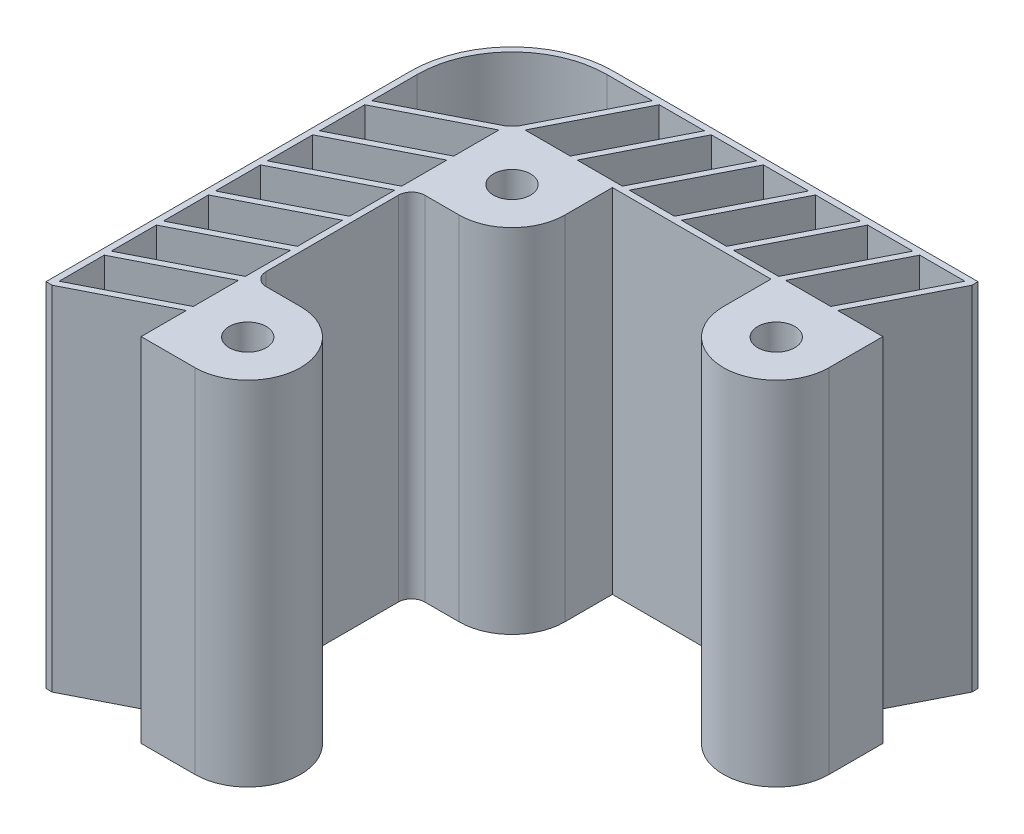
ISO-10303-21;
HEADER;
FILE_DESCRIPTION(('STEP AP214'),'2;1');
FILE_NAME('part.step','',(''),(''),'','','');
FILE_SCHEMA(('AUTOMOTIVE_DESIGN { 1 0 10303 214 1 1 1 1 }'));
ENDSEC;
DATA;
#1=APPLICATION_CONTEXT('core data for automotive mechanical design processes');
#2=APPLICATION_PROTOCOL_DEFINITION('international standard','automotive_design',2000,#1);
#3=PRODUCT_CONTEXT('',#1,'mechanical');
#4=PRODUCT('Part','Part','',(#3));
#5=PRODUCT_RELATED_PRODUCT_CATEGORY('part','',(#4));
#6=PRODUCT_DEFINITION_FORMATION('','',#4);
#7=PRODUCT_DEFINITION_CONTEXT('part definition',#1,'design');
#8=PRODUCT_DEFINITION('design','',#6,#7);
#9=PRODUCT_DEFINITION_SHAPE('','',#8);
#10=(LENGTH_UNIT() NAMED_UNIT(*) SI_UNIT(.MILLI.,.METRE.));
#11=(NAMED_UNIT(*) PLANE_ANGLE_UNIT() SI_UNIT($,.RADIAN.));
#12=(NAMED_UNIT(*) SI_UNIT($,.STERADIAN.) SOLID_ANGLE_UNIT());
#13=UNCERTAINTY_MEASURE_WITH_UNIT(LENGTH_MEASURE(1.E-05),#10,'distance_accuracy_value','');
#14=(GEOMETRIC_REPRESENTATION_CONTEXT(3) GLOBAL_UNCERTAINTY_ASSIGNED_CONTEXT((#13)) GLOBAL_UNIT_ASSIGNED_CONTEXT((#10,
#11,#12)) REPRESENTATION_CONTEXT('',''));
#15=CARTESIAN_POINT('',(0.,0.,0.));
#16=DIRECTION('',(0.,0.,1.));
#17=DIRECTION('',(1.,0.,0.));
#18=AXIS2_PLACEMENT_3D('',#15,#16,#17);
#19=CARTESIAN_POINT('',(0.,40.,0.));
#20=DIRECTION('',(0.,1.,0.));
#21=DIRECTION('',(0.,0.,1.));
#22=AXIS2_PLACEMENT_3D('',#19,#20,#21);
#23=PLANE('',#22);
#24=DIRECTION('',(-1.,0.,0.));
#25=VECTOR('',#24,1.);
#26=CARTESIAN_POINT('',(1.64368112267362E-13,40.,-16.1999999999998));
#27=LINE('',#26,#25);
#28=CARTESIAN_POINT('',(17.4720491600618,40.,-16.1999999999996));
#29=VERTEX_POINT('',#28);
#30=CARTESIAN_POINT('',(12.3428571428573,40.,-16.1999999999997));
#31=VERTEX_POINT('',#30);
#32=EDGE_CURVE('E425',#29,#31,#27,.T.);
#33=ORIENTED_EDGE('',*,*,#32,.F.);
#34=DIRECTION('',(0.452797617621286,0.,-0.891613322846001));
#35=VECTOR('',#34,1.);
#36=CARTESIAN_POINT('',(7.349560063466,40.,3.73240641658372));
#37=LINE('',#36,#35);
#38=CARTESIAN_POINT('',(12.3428571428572,40.,-6.0999999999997));
#39=VERTEX_POINT('',#38);
#40=EDGE_CURVE('E1228',#39,#29,#37,.T.);
#41=ORIENTED_EDGE('',*,*,#40,.F.);
#42=DIRECTION('',(1.,0.,0.));
#43=VECTOR('',#42,1.);
#44=CARTESIAN_POINT('',(0.,40.,-6.09999999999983));
#45=LINE('',#44,#43);
#46=CARTESIAN_POINT('',(7.21366512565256,40.,-6.09999999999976));
#47=VERTEX_POINT('',#46);
#48=EDGE_CURVE('E1242',#47,#39,#45,.T.);
#49=ORIENTED_EDGE('',*,*,#48,.F.);
#50=DIRECTION('',(-0.452797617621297,0.,0.891613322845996));
#51=VECTOR('',#50,1.);
#52=CARTESIAN_POINT('',(3.27198414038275,40.,1.66164702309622));
#53=LINE('',#52,#51);
#54=EDGE_CURVE('E1239',#31,#47,#53,.T.);
#55=ORIENTED_EDGE('',*,*,#54,.F.);
#56=EDGE_LOOP('',(#33,#41,#49,#55));
#57=FACE_BOUND('',#56,.T.);
#58=DIRECTION('',(-1.,0.,0.));
#59=VECTOR('',#58,1.);
#60=CARTESIAN_POINT('',(1.75325986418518E-13,40.,-16.1999999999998));
#61=LINE('',#60,#59);
#62=CARTESIAN_POINT('',(23.3863348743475,40.,-16.1999999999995));
#63=VERTEX_POINT('',#62);
#64=CARTESIAN_POINT('',(18.257142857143,40.,-16.1999999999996));
#65=VERTEX_POINT('',#64);
#66=EDGE_CURVE('E433',#63,#65,#61,.T.);
#67=ORIENTED_EDGE('',*,*,#66,.F.);
#68=DIRECTION('',(0.452797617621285,0.,-0.891613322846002));
#69=VECTOR('',#68,1.);
#70=CARTESIAN_POINT('',(12.0512653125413,40.,6.12012414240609));
#71=LINE('',#70,#69);
#72=CARTESIAN_POINT('',(18.2571428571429,40.,-6.09999999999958));
#73=VERTEX_POINT('',#72);
#74=EDGE_CURVE('E1198',#73,#63,#71,.T.);
#75=ORIENTED_EDGE('',*,*,#74,.F.);
#76=DIRECTION('',(1.,0.,0.));
#77=VECTOR('',#76,1.);
#78=CARTESIAN_POINT('',(0.,40.,-6.09999999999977));
#79=LINE('',#78,#77);
#80=CARTESIAN_POINT('',(13.1279508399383,40.,-6.09999999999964));
#81=VERTEX_POINT('',#80);
#82=EDGE_CURVE('E1212',#81,#73,#79,.T.);
#83=ORIENTED_EDGE('',*,*,#82,.F.);
#84=DIRECTION('',(-0.452797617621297,0.,0.891613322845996));
#85=VECTOR('',#84,1.);
#86=CARTESIAN_POINT('',(7.97368938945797,40.,4.04936474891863));
#87=LINE('',#86,#85);
#88=EDGE_CURVE('E1209',#65,#81,#87,.T.);
#89=ORIENTED_EDGE('',*,*,#88,.F.);
#90=EDGE_LOOP('',(#67,#75,#83,#89));
#91=FACE_BOUND('',#90,.T.);
#92=DIRECTION('',(-1.,0.,0.));
#93=VECTOR('',#92,1.);
#94=CARTESIAN_POINT('',(1.64368112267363E-13,40.,-16.1999999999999));
#95=LINE('',#94,#93);
#96=CARTESIAN_POINT('',(5.64347773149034,40.,-16.1999999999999));
#97=VERTEX_POINT('',#96);
#98=CARTESIAN_POINT('',(0.514285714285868,40.,-16.1999999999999));
#99=VERTEX_POINT('',#98);
#100=EDGE_CURVE('E1280',#97,#99,#95,.T.);
#101=ORIENTED_EDGE('',*,*,#100,.F.);
#102=DIRECTION('',(0.452797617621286,0.,-0.891613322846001));
#103=VECTOR('',#102,1.);
#104=CARTESIAN_POINT('',(-2.05385043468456,40.,-1.04302903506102));
#105=LINE('',#104,#103);
#106=CARTESIAN_POINT('',(0.514285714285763,40.,-6.09999999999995));
#107=VERTEX_POINT('',#106);
#108=EDGE_CURVE('E1291',#107,#97,#105,.T.);
#109=ORIENTED_EDGE('',*,*,#108,.F.);
#110=DIRECTION('',(1.,0.,0.));
#111=VECTOR('',#110,1.);
#112=CARTESIAN_POINT('',(0.,40.,-6.09999999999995));
#113=LINE('',#112,#111);
#114=CARTESIAN_POINT('',(-4.61490630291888,40.,-6.1));
#115=VERTEX_POINT('',#114);
#116=EDGE_CURVE('E1305',#115,#107,#113,.T.);
#117=ORIENTED_EDGE('',*,*,#116,.F.);
#118=DIRECTION('',(-0.452797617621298,0.,0.891613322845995));
#119=VECTOR('',#118,1.);
#120=CARTESIAN_POINT('',(-6.13142635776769,40.,-3.11378842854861));
#121=LINE('',#120,#119);
#122=EDGE_CURVE('E1302',#99,#115,#121,.T.);
#123=ORIENTED_EDGE('',*,*,#122,.F.);
#124=EDGE_LOOP('',(#101,#109,#117,#123));
#125=FACE_BOUND('',#124,.T.);
#126=DIRECTION('',(-1.,0.,0.));
#127=VECTOR('',#126,1.);
#128=CARTESIAN_POINT('',(1.64368112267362E-13,40.,-16.1999999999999));
#129=LINE('',#128,#127);
#130=CARTESIAN_POINT('',(11.5577634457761,40.,-16.1999999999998));
#131=VERTEX_POINT('',#130);
#132=CARTESIAN_POINT('',(6.42857142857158,40.,-16.1999999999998));
#133=VERTEX_POINT('',#132);
#134=EDGE_CURVE('E1249',#131,#133,#129,.T.);
#135=ORIENTED_EDGE('',*,*,#134,.F.);
#136=DIRECTION('',(0.452797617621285,0.,-0.891613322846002));
#137=VECTOR('',#136,1.);
#138=CARTESIAN_POINT('',(2.64785481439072,40.,1.34468869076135));
#139=LINE('',#138,#137);
#140=CARTESIAN_POINT('',(6.42857142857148,40.,-6.09999999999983));
#141=VERTEX_POINT('',#140);
#142=EDGE_CURVE('E1259',#141,#131,#139,.T.);
#143=ORIENTED_EDGE('',*,*,#142,.F.);
#144=DIRECTION('',(1.,0.,0.));
#145=VECTOR('',#144,1.);
#146=CARTESIAN_POINT('',(0.,40.,-6.09999999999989));
#147=LINE('',#146,#145);
#148=CARTESIAN_POINT('',(1.29937941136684,40.,-6.09999999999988));
#149=VERTEX_POINT('',#148);
#150=EDGE_CURVE('E1273',#149,#141,#147,.T.);
#151=ORIENTED_EDGE('',*,*,#150,.F.);
#152=DIRECTION('',(-0.452797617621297,0.,0.891613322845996));
#153=VECTOR('',#152,1.);
#154=CARTESIAN_POINT('',(-1.42972110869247,40.,-0.726070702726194));
#155=LINE('',#154,#153);
#156=EDGE_CURVE('E1270',#133,#149,#155,.T.);
#157=ORIENTED_EDGE('',*,*,#156,.F.);
#158=EDGE_LOOP('',(#135,#143,#151,#157));
#159=FACE_BOUND('',#158,.T.);
#160=DIRECTION('',(1.,0.,0.));
#161=VECTOR('',#160,1.);
#162=CARTESIAN_POINT('',(0.,40.,-6.09999999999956));
#163=LINE('',#162,#161);
#164=CARTESIAN_POINT('',(30.8708079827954,40.,-6.09999999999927));
#165=VERTEX_POINT('',#164);
#166=CARTESIAN_POINT('',(36.,40.,-6.09999999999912));
#167=VERTEX_POINT('',#166);
#168=EDGE_CURVE('E1116',#165,#167,#163,.T.);
#169=ORIENTED_EDGE('',*,*,#168,.F.);
#170=DIRECTION('',(-0.4527976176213,0.,0.891613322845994));
#171=VECTOR('',#170,1.);
#172=CARTESIAN_POINT('',(22.0788051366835,40.,11.2125179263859));
#173=LINE('',#172,#171);
#174=CARTESIAN_POINT('',(36.,40.,-16.1999999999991));
#175=VERTEX_POINT('',#174);
#176=EDGE_CURVE('E1120',#175,#165,#173,.T.);
#177=ORIENTED_EDGE('',*,*,#176,.F.);
#178=DIRECTION('',(0.,0.,-1.));
#179=VECTOR('',#178,1.);
#180=CARTESIAN_POINT('',(36.,40.,0.));
#181=LINE('',#180,#179);
#182=CARTESIAN_POINT('',(36.,40.,-16.9));
#183=VERTEX_POINT('',#182);
#184=EDGE_CURVE('E1394',#175,#183,#181,.T.);
#185=ORIENTED_EDGE('',*,*,#184,.T.);
#186=DIRECTION('',(-1.,0.,0.));
#187=VECTOR('',#186,1.);
#188=CARTESIAN_POINT('',(36.,40.,-16.9));
#189=LINE('',#188,#187);
#190=CARTESIAN_POINT('',(-5.39999999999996,40.,-16.9));
#191=VERTEX_POINT('',#190);
#192=EDGE_CURVE('E1398',#183,#191,#189,.T.);
#193=ORIENTED_EDGE('',*,*,#192,.T.);
#194=CARTESIAN_POINT('',(-5.39999999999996,40.,-5.40000000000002));
#195=DIRECTION('',(0.,1.,0.));
#196=DIRECTION('',(0.,0.,1.));
#197=AXIS2_PLACEMENT_3D('',#194,#195,#196);
#198=CIRCLE('',#197,11.5);
#199=CARTESIAN_POINT('',(-16.9,40.,-5.40000000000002));
#200=VERTEX_POINT('',#199);
#201=EDGE_CURVE('E1076',#200,#191,#198,.F.);
#202=ORIENTED_EDGE('',*,*,#201,.F.);
#203=DIRECTION('',(0.,0.,1.));
#204=VECTOR('',#203,1.);
#205=CARTESIAN_POINT('',(-16.9,40.,-16.9));
#206=LINE('',#205,#204);
#207=CARTESIAN_POINT('',(-16.9,40.,36.));
#208=VERTEX_POINT('',#207);
#209=EDGE_CURVE('E1401',#200,#208,#206,.T.);
#210=ORIENTED_EDGE('',*,*,#209,.T.);
#211=DIRECTION('',(1.,0.,0.));
#212=VECTOR('',#211,1.);
#213=CARTESIAN_POINT('',(-16.9,40.,36.));
#214=LINE('',#213,#212);
#215=CARTESIAN_POINT('',(-16.1999999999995,40.,36.));
#216=VERTEX_POINT('',#215);
#217=EDGE_CURVE('E1404',#208,#216,#214,.T.);
#218=ORIENTED_EDGE('',*,*,#217,.T.);
#219=DIRECTION('',(0.891613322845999,0.,-0.452797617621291));
#220=VECTOR('',#219,1.);
#221=CARTESIAN_POINT('',(11.2125179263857,40.,22.0788051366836));
#222=LINE('',#221,#220);
#223=CARTESIAN_POINT('',(-6.09999999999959,40.,30.8708079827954));
#224=VERTEX_POINT('',#223);
#225=EDGE_CURVE('E907',#216,#224,#222,.T.);
#226=ORIENTED_EDGE('',*,*,#225,.T.);
#227=DIRECTION('',(0.,0.,1.));
#228=VECTOR('',#227,1.);
#229=CARTESIAN_POINT('',(-6.09999999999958,40.,0.));
#230=LINE('',#229,#228);
#231=CARTESIAN_POINT('',(-6.09999999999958,40.,36.));
#232=VERTEX_POINT('',#231);
#233=EDGE_CURVE('E898',#224,#232,#230,.T.);
#234=ORIENTED_EDGE('',*,*,#233,.T.);
#235=CARTESIAN_POINT('',(0.,40.,36.));
#236=VERTEX_POINT('',#235);
#237=EDGE_CURVE('E1403',#232,#236,#214,.T.);
#238=ORIENTED_EDGE('',*,*,#237,.T.);
#239=CARTESIAN_POINT('',(0.,40.,30.));
#240=DIRECTION('',(0.,1.,0.));
#241=DIRECTION('',(0.,0.,1.));
#242=AXIS2_PLACEMENT_3D('',#239,#240,#241);
#243=CIRCLE('',#242,6.);
#244=CARTESIAN_POINT('',(0.,40.,24.));
#245=VERTEX_POINT('',#244);
#246=EDGE_CURVE('E1407',#236,#245,#243,.T.);
#247=ORIENTED_EDGE('',*,*,#246,.T.);
#248=DIRECTION('',(-1.,0.,0.));
#249=VECTOR('',#248,1.);
#250=CARTESIAN_POINT('',(0.,40.,24.));
#251=LINE('',#250,#249);
#252=CARTESIAN_POINT('',(-3.90000000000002,40.,24.));
#253=VERTEX_POINT('',#252);
#254=EDGE_CURVE('E1409',#245,#253,#251,.T.);
#255=ORIENTED_EDGE('',*,*,#254,.T.);
#256=CARTESIAN_POINT('',(-3.90000000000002,40.,22.5));
#257=DIRECTION('',(0.,1.,0.));
#258=DIRECTION('',(0.,0.,1.));
#259=AXIS2_PLACEMENT_3D('',#256,#257,#258);
#260=CIRCLE('',#259,1.5);
#261=CARTESIAN_POINT('',(-5.40000000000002,40.,22.5));
#262=VERTEX_POINT('',#261);
#263=EDGE_CURVE('E12',#253,#262,#260,.F.);
#264=ORIENTED_EDGE('',*,*,#263,.T.);
#265=DIRECTION('',(0.,0.,-1.));
#266=VECTOR('',#265,1.);
#267=CARTESIAN_POINT('',(-5.40000000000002,40.,24.));
#268=LINE('',#267,#266);
#269=CARTESIAN_POINT('',(-5.40000000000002,40.,7.50000000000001));
#270=VERTEX_POINT('',#269);
#271=EDGE_CURVE('E1412',#262,#270,#268,.T.);
#272=ORIENTED_EDGE('',*,*,#271,.T.);
#273=CARTESIAN_POINT('',(-3.90000000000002,40.,7.50000000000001));
#274=DIRECTION('',(0.,1.,0.));
#275=DIRECTION('',(0.,0.,1.));
#276=AXIS2_PLACEMENT_3D('',#273,#274,#275);
#277=CIRCLE('',#276,1.5);
#278=CARTESIAN_POINT('',(-3.90000000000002,40.,6.00000000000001));
#279=VERTEX_POINT('',#278);
#280=EDGE_CURVE('E1489',#270,#279,#277,.F.);
#281=ORIENTED_EDGE('',*,*,#280,.T.);
#282=DIRECTION('',(1.,0.,0.));
#283=VECTOR('',#282,1.);
#284=CARTESIAN_POINT('',(-5.40000000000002,40.,6.00000000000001));
#285=LINE('',#284,#283);
#286=CARTESIAN_POINT('',(0.,40.,6.));
#287=VERTEX_POINT('',#286);
#288=EDGE_CURVE('E1415',#279,#287,#285,.T.);
#289=ORIENTED_EDGE('',*,*,#288,.T.);
#290=CARTESIAN_POINT('',(0.,40.,0.));
#291=DIRECTION('',(0.,1.,0.));
#292=DIRECTION('',(0.,0.,1.));
#293=AXIS2_PLACEMENT_3D('',#290,#291,#292);
#294=CIRCLE('',#293,6.);
#295=CARTESIAN_POINT('',(6.,40.,0.));
#296=VERTEX_POINT('',#295);
#297=EDGE_CURVE('E1382',#287,#296,#294,.T.);
#298=ORIENTED_EDGE('',*,*,#297,.T.);
#299=DIRECTION('',(0.,0.,-1.));
#300=VECTOR('',#299,1.);
#301=CARTESIAN_POINT('',(6.,40.,0.));
#302=LINE('',#301,#300);
#303=CARTESIAN_POINT('',(6.00000000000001,40.,-5.40000000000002));
#304=VERTEX_POINT('',#303);
#305=EDGE_CURVE('E1385',#296,#304,#302,.T.);
#306=ORIENTED_EDGE('',*,*,#305,.T.);
#307=DIRECTION('',(1.,0.,0.));
#308=VECTOR('',#307,1.);
#309=CARTESIAN_POINT('',(6.00000000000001,40.,-5.40000000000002));
#310=LINE('',#309,#308);
#311=CARTESIAN_POINT('',(24.,40.,-5.40000000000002));
#312=VERTEX_POINT('',#311);
#313=EDGE_CURVE('E1388',#304,#312,#310,.T.);
#314=ORIENTED_EDGE('',*,*,#313,.T.);
#315=DIRECTION('',(0.,0.,1.));
#316=VECTOR('',#315,1.);
#317=CARTESIAN_POINT('',(24.,40.,-5.40000000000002));
#318=LINE('',#317,#316);
#319=CARTESIAN_POINT('',(24.,40.,0.));
#320=VERTEX_POINT('',#319);
#321=EDGE_CURVE('E1390',#312,#320,#318,.T.);
#322=ORIENTED_EDGE('',*,*,#321,.T.);
#323=CARTESIAN_POINT('',(30.,40.,0.));
#324=DIRECTION('',(0.,1.,0.));
#325=DIRECTION('',(0.,0.,1.));
#326=AXIS2_PLACEMENT_3D('',#323,#324,#325);
#327=CIRCLE('',#326,6.);
#328=CARTESIAN_POINT('',(36.,40.,0.));
#329=VERTEX_POINT('',#328);
#330=EDGE_CURVE('E1392',#320,#329,#327,.T.);
#331=ORIENTED_EDGE('',*,*,#330,.T.);
#332=EDGE_CURVE('E1395',#329,#167,#181,.T.);
#333=ORIENTED_EDGE('',*,*,#332,.T.);
#334=EDGE_LOOP('',(#169,#177,#185,#193,#202,#210,#218,#226,#234,#238,#247,#255,#264,#272,#281,
#289,#298,#306,#314,#322,#331,#333));
#335=FACE_BOUND('',#334,.T.);
#336=DIRECTION('',(-1.,0.,0.));
#337=VECTOR('',#336,1.);
#338=CARTESIAN_POINT('',(1.75325986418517E-13,40.,-16.1999999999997));
#339=LINE('',#338,#337);
#340=CARTESIAN_POINT('',(29.3006205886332,40.,-16.1999999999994));
#341=VERTEX_POINT('',#340);
#342=CARTESIAN_POINT('',(24.1714285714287,40.,-16.1999999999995));
#343=VERTEX_POINT('',#342);
#344=EDGE_CURVE('E1156',#341,#343,#339,.T.);
#345=ORIENTED_EDGE('',*,*,#344,.F.);
#346=DIRECTION('',(0.452797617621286,0.,-0.891613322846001));
#347=VECTOR('',#346,1.);
#348=CARTESIAN_POINT('',(16.7529705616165,40.,8.50784186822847));
#349=LINE('',#348,#347);
#350=CARTESIAN_POINT('',(24.1714285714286,40.,-6.09999999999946));
#351=VERTEX_POINT('',#350);
#352=EDGE_CURVE('E1167',#351,#341,#349,.T.);
#353=ORIENTED_EDGE('',*,*,#352,.F.);
#354=DIRECTION('',(1.,0.,0.));
#355=VECTOR('',#354,1.);
#356=CARTESIAN_POINT('',(0.,40.,-6.09999999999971));
#357=LINE('',#356,#355);
#358=CARTESIAN_POINT('',(19.042236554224,40.,-6.09999999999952));
#359=VERTEX_POINT('',#358);
#360=EDGE_CURVE('E1181',#359,#351,#357,.T.);
#361=ORIENTED_EDGE('',*,*,#360,.F.);
#362=DIRECTION('',(-0.452797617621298,0.,0.891613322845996));
#363=VECTOR('',#362,1.);
#364=CARTESIAN_POINT('',(12.6753946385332,40.,6.43708247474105));
#365=LINE('',#364,#363);
#366=EDGE_CURVE('E1178',#343,#359,#365,.T.);
#367=ORIENTED_EDGE('',*,*,#366,.F.);
#368=EDGE_LOOP('',(#345,#353,#361,#367));
#369=FACE_BOUND('',#368,.T.);
#370=DIRECTION('',(-1.,0.,0.));
#371=VECTOR('',#370,1.);
#372=CARTESIAN_POINT('',(1.53410238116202E-13,40.,-16.1999999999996));
#373=LINE('',#372,#371);
#374=CARTESIAN_POINT('',(35.2149063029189,40.,-16.1999999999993));
#375=VERTEX_POINT('',#374);
#376=CARTESIAN_POINT('',(30.0857142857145,40.,-16.1999999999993));
#377=VERTEX_POINT('',#376);
#378=EDGE_CURVE('E1127',#375,#377,#373,.T.);
#379=ORIENTED_EDGE('',*,*,#378,.F.);
#380=DIRECTION('',(0.452797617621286,0.,-0.891613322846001));
#381=VECTOR('',#380,1.);
#382=CARTESIAN_POINT('',(21.4546758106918,40.,10.8955595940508));
#383=LINE('',#382,#381);
#384=CARTESIAN_POINT('',(30.0857142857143,40.,-6.09999999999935));
#385=VERTEX_POINT('',#384);
#386=EDGE_CURVE('E1135',#385,#375,#383,.T.);
#387=ORIENTED_EDGE('',*,*,#386,.F.);
#388=DIRECTION('',(1.,0.,0.));
#389=VECTOR('',#388,1.);
#390=CARTESIAN_POINT('',(0.,40.,-6.09999999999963));
#391=LINE('',#390,#389);
#392=CARTESIAN_POINT('',(24.9565222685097,40.,-6.09999999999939));
#393=VERTEX_POINT('',#392);
#394=EDGE_CURVE('E1149',#393,#385,#391,.T.);
#395=ORIENTED_EDGE('',*,*,#394,.F.);
#396=DIRECTION('',(-0.452797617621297,0.,0.891613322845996));
#397=VECTOR('',#396,1.);
#398=CARTESIAN_POINT('',(17.3770998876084,40.,8.82480020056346));
#399=LINE('',#398,#397);
#400=EDGE_CURVE('E1146',#377,#393,#399,.T.);
#401=ORIENTED_EDGE('',*,*,#400,.F.);
#402=EDGE_LOOP('',(#379,#387,#395,#401));
#403=FACE_BOUND('',#402,.T.);
#404=CARTESIAN_POINT('',(0.,40.,30.));
#405=DIRECTION('',(0.,1.,0.));
#406=DIRECTION('',(0.,0.,1.));
#407=AXIS2_PLACEMENT_3D('',#404,#405,#406);
#408=CIRCLE('',#407,2.09999999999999);
#409=CARTESIAN_POINT('',(0.,40.,32.1));
#410=VERTEX_POINT('',#409);
#411=EDGE_CURVE('E1370',#410,#410,#408,.T.);
#412=ORIENTED_EDGE('',*,*,#411,.F.);
#413=EDGE_LOOP('',(#412));
#414=FACE_BOUND('',#413,.T.);
#415=CARTESIAN_POINT('',(30.,40.,0.));
#416=DIRECTION('',(0.,1.,0.));
#417=DIRECTION('',(0.,0.,1.));
#418=AXIS2_PLACEMENT_3D('',#415,#416,#417);
#419=CIRCLE('',#418,2.09999999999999);
#420=CARTESIAN_POINT('',(30.,40.,2.09999999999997));
#421=VERTEX_POINT('',#420);
#422=EDGE_CURVE('E1376',#421,#421,#419,.T.);
#423=ORIENTED_EDGE('',*,*,#422,.F.);
#424=EDGE_LOOP('',(#423));
#425=FACE_BOUND('',#424,.T.);
#426=CARTESIAN_POINT('',(0.,40.,0.));
#427=DIRECTION('',(0.,1.,0.));
#428=DIRECTION('',(0.,0.,1.));
#429=AXIS2_PLACEMENT_3D('',#426,#427,#428);
#430=CIRCLE('',#429,2.09999999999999);
#431=CARTESIAN_POINT('',(0.,40.,2.09999999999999));
#432=VERTEX_POINT('',#431);
#433=EDGE_CURVE('E1364',#432,#432,#430,.T.);
#434=ORIENTED_EDGE('',*,*,#433,.F.);
#435=EDGE_LOOP('',(#434));
#436=FACE_BOUND('',#435,.T.);
#437=DIRECTION('',(0.,0.,-1.));
#438=VECTOR('',#437,1.);
#439=CARTESIAN_POINT('',(-16.2,40.,0.));
#440=LINE('',#439,#438);
#441=CARTESIAN_POINT('',(-16.2,40.,-0.270807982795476));
#442=VERTEX_POINT('',#441);
#443=CARTESIAN_POINT('',(-16.2,40.,-5.40000000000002));
#444=VERTEX_POINT('',#443);
#445=EDGE_CURVE('E1337',#442,#444,#440,.T.);
#446=ORIENTED_EDGE('',*,*,#445,.T.);
#447=CARTESIAN_POINT('',(-5.39999999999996,40.,-5.40000000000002));
#448=DIRECTION('',(0.,1.,0.));
#449=DIRECTION('',(0.,0.,1.));
#450=AXIS2_PLACEMENT_3D('',#447,#448,#449);
#451=CIRCLE('',#450,10.7999999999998);
#452=CARTESIAN_POINT('',(-5.39999999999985,40.,-16.1999999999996));
#453=VERTEX_POINT('',#452);
#454=EDGE_CURVE('E1082',#444,#453,#451,.F.);
#455=ORIENTED_EDGE('',*,*,#454,.T.);
#456=DIRECTION('',(-1.,0.,0.));
#457=VECTOR('',#456,1.);
#458=CARTESIAN_POINT('',(-1.183450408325E-12,40.,-16.2));
#459=LINE('',#458,#457);
#460=CARTESIAN_POINT('',(-0.27080798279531,40.,-16.2));
#461=VERTEX_POINT('',#460);
#462=EDGE_CURVE('E1320',#461,#453,#459,.T.);
#463=ORIENTED_EDGE('',*,*,#462,.F.);
#464=DIRECTION('',(0.45279761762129,0.,-0.891613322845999));
#465=VECTOR('',#464,1.);
#466=CARTESIAN_POINT('',(-6.75555568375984,40.,-3.43074676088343));
#467=LINE('',#466,#465);
#468=CARTESIAN_POINT('',(-5.39999999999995,40.,-6.10000000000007));
#469=VERTEX_POINT('',#468);
#470=EDGE_CURVE('E1346',#469,#461,#467,.T.);
#471=ORIENTED_EDGE('',*,*,#470,.F.);
#472=DIRECTION('',(0.70710678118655,0.,-0.707106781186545));
#473=VECTOR('',#472,1.);
#474=CARTESIAN_POINT('',(-5.74999999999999,40.,-5.75000000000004));
#475=LINE('',#474,#473);
#476=CARTESIAN_POINT('',(-6.10000000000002,40.,-5.40000000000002));
#477=VERTEX_POINT('',#476);
#478=EDGE_CURVE('E1343',#477,#469,#475,.T.);
#479=ORIENTED_EDGE('',*,*,#478,.F.);
#480=DIRECTION('',(-0.891613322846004,0.,0.452797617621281));
#481=VECTOR('',#480,1.);
#482=CARTESIAN_POINT('',(-3.43074676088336,40.,-6.75555568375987));
#483=LINE('',#482,#481);
#484=EDGE_CURVE('E1340',#477,#442,#483,.T.);
#485=ORIENTED_EDGE('',*,*,#484,.T.);
#486=EDGE_LOOP('',(#446,#455,#463,#471,#479,#485));
#487=FACE_BOUND('',#486,.T.);
#488=DIRECTION('',(-0.891613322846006,0.,0.452797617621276));
#489=VECTOR('',#488,1.);
#490=CARTESIAN_POINT('',(8.50784186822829,40.,16.7529705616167));
#491=LINE('',#490,#489);
#492=CARTESIAN_POINT('',(-6.09999999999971,40.,24.1714285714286));
#493=VERTEX_POINT('',#492);
#494=CARTESIAN_POINT('',(-16.1999999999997,40.,29.3006205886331));
#495=VERTEX_POINT('',#494);
#496=EDGE_CURVE('E961',#493,#495,#491,.T.);
#497=ORIENTED_EDGE('',*,*,#496,.T.);
#498=DIRECTION('',(0.,0.,-1.));
#499=VECTOR('',#498,1.);
#500=CARTESIAN_POINT('',(-16.1999999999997,40.,0.));
#501=LINE('',#500,#499);
#502=CARTESIAN_POINT('',(-16.1999999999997,40.,24.1714285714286));
#503=VERTEX_POINT('',#502);
#504=EDGE_CURVE('E941',#495,#503,#501,.T.);
#505=ORIENTED_EDGE('',*,*,#504,.T.);
#506=DIRECTION('',(0.891613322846,0.,-0.452797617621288));
#507=VECTOR('',#506,1.);
#508=CARTESIAN_POINT('',(6.43708247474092,40.,12.6753946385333));
#509=LINE('',#508,#507);
#510=CARTESIAN_POINT('',(-6.09999999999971,40.,19.0422365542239));
#511=VERTEX_POINT('',#510);
#512=EDGE_CURVE('E951',#503,#511,#509,.T.);
#513=ORIENTED_EDGE('',*,*,#512,.T.);
#514=DIRECTION('',(0.,0.,1.));
#515=VECTOR('',#514,1.);
#516=CARTESIAN_POINT('',(-6.09999999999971,40.,0.));
#517=LINE('',#516,#515);
#518=EDGE_CURVE('E964',#511,#493,#517,.T.);
#519=ORIENTED_EDGE('',*,*,#518,.T.);
#520=EDGE_LOOP('',(#497,#505,#513,#519));
#521=FACE_BOUND('',#520,.T.);
#522=DIRECTION('',(-0.891613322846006,0.,0.452797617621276));
#523=VECTOR('',#522,1.);
#524=CARTESIAN_POINT('',(6.12012414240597,40.,12.0512653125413));
#525=LINE('',#524,#523);
#526=CARTESIAN_POINT('',(-6.09999999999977,40.,18.2571428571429));
#527=VERTEX_POINT('',#526);
#528=CARTESIAN_POINT('',(-16.1999999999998,40.,23.3863348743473));
#529=VERTEX_POINT('',#528);
#530=EDGE_CURVE('E992',#527,#529,#525,.T.);
#531=ORIENTED_EDGE('',*,*,#530,.T.);
#532=DIRECTION('',(0.,0.,-1.));
#533=VECTOR('',#532,1.);
#534=CARTESIAN_POINT('',(-16.1999999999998,40.,0.));
#535=LINE('',#534,#533);
#536=CARTESIAN_POINT('',(-16.1999999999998,40.,18.2571428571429));
#537=VERTEX_POINT('',#536);
#538=EDGE_CURVE('E972',#529,#537,#535,.T.);
#539=ORIENTED_EDGE('',*,*,#538,.T.);
#540=DIRECTION('',(0.891613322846,0.,-0.452797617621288));
#541=VECTOR('',#540,1.);
#542=CARTESIAN_POINT('',(4.04936474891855,40.,7.97368938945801));
#543=LINE('',#542,#541);
#544=CARTESIAN_POINT('',(-6.09999999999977,40.,13.1279508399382));
#545=VERTEX_POINT('',#544);
#546=EDGE_CURVE('E982',#537,#545,#543,.T.);
#547=ORIENTED_EDGE('',*,*,#546,.T.);
#548=DIRECTION('',(0.,0.,1.));
#549=VECTOR('',#548,1.);
#550=CARTESIAN_POINT('',(-6.09999999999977,40.,0.));
#551=LINE('',#550,#549);
#552=EDGE_CURVE('E995',#545,#527,#551,.T.);
#553=ORIENTED_EDGE('',*,*,#552,.T.);
#554=EDGE_LOOP('',(#531,#539,#547,#553));
#555=FACE_BOUND('',#554,.T.);
#556=DIRECTION('',(-0.891613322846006,0.,0.452797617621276));
#557=VECTOR('',#556,1.);
#558=CARTESIAN_POINT('',(10.8955595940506,40.,21.454675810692));
#559=LINE('',#558,#557);
#560=CARTESIAN_POINT('',(-6.09999999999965,40.,30.0857142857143));
#561=VERTEX_POINT('',#560);
#562=CARTESIAN_POINT('',(-16.1999999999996,40.,35.2149063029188));
#563=VERTEX_POINT('',#562);
#564=EDGE_CURVE('E930',#561,#563,#559,.T.);
#565=ORIENTED_EDGE('',*,*,#564,.T.);
#566=DIRECTION('',(0.,0.,-1.));
#567=VECTOR('',#566,1.);
#568=CARTESIAN_POINT('',(-16.1999999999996,40.,0.));
#569=LINE('',#568,#567);
#570=CARTESIAN_POINT('',(-16.1999999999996,40.,30.0857142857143));
#571=VERTEX_POINT('',#570);
#572=EDGE_CURVE('E915',#563,#571,#569,.T.);
#573=ORIENTED_EDGE('',*,*,#572,.T.);
#574=DIRECTION('',(0.891613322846,0.,-0.452797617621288));
#575=VECTOR('',#574,1.);
#576=CARTESIAN_POINT('',(8.82480020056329,40.,17.3770998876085));
#577=LINE('',#576,#575);
#578=CARTESIAN_POINT('',(-6.09999999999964,40.,24.9565222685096));
#579=VERTEX_POINT('',#578);
#580=EDGE_CURVE('E920',#571,#579,#577,.T.);
#581=ORIENTED_EDGE('',*,*,#580,.T.);
#582=DIRECTION('',(0.,0.,1.));
#583=VECTOR('',#582,1.);
#584=CARTESIAN_POINT('',(-6.09999999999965,40.,0.));
#585=LINE('',#584,#583);
#586=EDGE_CURVE('E933',#579,#561,#585,.T.);
#587=ORIENTED_EDGE('',*,*,#586,.T.);
#588=EDGE_LOOP('',(#565,#573,#581,#587));
#589=FACE_BOUND('',#588,.T.);
#590=DIRECTION('',(-0.891613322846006,0.,0.452797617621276));
#591=VECTOR('',#590,1.);
#592=CARTESIAN_POINT('',(-1.04302903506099,40.,-2.05385043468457));
#593=LINE('',#592,#591);
#594=CARTESIAN_POINT('',(-6.09999999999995,40.,0.514285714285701));
#595=VERTEX_POINT('',#594);
#596=CARTESIAN_POINT('',(-16.1999999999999,40.,5.64347773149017));
#597=VERTEX_POINT('',#596);
#598=EDGE_CURVE('E1097',#595,#597,#593,.T.);
#599=ORIENTED_EDGE('',*,*,#598,.T.);
#600=DIRECTION('',(0.,0.,-1.));
#601=VECTOR('',#600,1.);
#602=CARTESIAN_POINT('',(-16.1999999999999,40.,0.));
#603=LINE('',#602,#601);
#604=CARTESIAN_POINT('',(-16.1999999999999,40.,0.514285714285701));
#605=VERTEX_POINT('',#604);
#606=EDGE_CURVE('E1065',#597,#605,#603,.T.);
#607=ORIENTED_EDGE('',*,*,#606,.T.);
#608=DIRECTION('',(0.891613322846,0.,-0.452797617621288));
#609=VECTOR('',#608,1.);
#610=CARTESIAN_POINT('',(-3.11378842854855,40.,-6.13142635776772));
#611=LINE('',#610,#609);
#612=CARTESIAN_POINT('',(-6.09999999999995,40.,-4.61490630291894));
#613=VERTEX_POINT('',#612);
#614=EDGE_CURVE('E1087',#605,#613,#611,.T.);
#615=ORIENTED_EDGE('',*,*,#614,.T.);
#616=DIRECTION('',(0.,0.,1.));
#617=VECTOR('',#616,1.);
#618=CARTESIAN_POINT('',(-6.09999999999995,40.,0.));
#619=LINE('',#618,#617);
#620=EDGE_CURVE('E1100',#613,#595,#619,.T.);
#621=ORIENTED_EDGE('',*,*,#620,.T.);
#622=EDGE_LOOP('',(#599,#607,#615,#621));
#623=FACE_BOUND('',#622,.T.);
#624=DIRECTION('',(-0.891613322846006,0.,0.452797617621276));
#625=VECTOR('',#624,1.);
#626=CARTESIAN_POINT('',(3.73240641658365,40.,7.34956006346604));
#627=LINE('',#626,#625);
#628=CARTESIAN_POINT('',(-6.09999999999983,40.,12.3428571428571));
#629=VERTEX_POINT('',#628);
#630=CARTESIAN_POINT('',(-16.1999999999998,40.,17.4720491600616));
#631=VERTEX_POINT('',#630);
#632=EDGE_CURVE('E1023',#629,#631,#627,.T.);
#633=ORIENTED_EDGE('',*,*,#632,.T.);
#634=DIRECTION('',(0.,0.,-1.));
#635=VECTOR('',#634,1.);
#636=CARTESIAN_POINT('',(-16.1999999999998,40.,0.));
#637=LINE('',#636,#635);
#638=CARTESIAN_POINT('',(-16.1999999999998,40.,12.3428571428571));
#639=VERTEX_POINT('',#638);
#640=EDGE_CURVE('E1003',#631,#639,#637,.T.);
#641=ORIENTED_EDGE('',*,*,#640,.T.);
#642=DIRECTION('',(0.891613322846,0.,-0.452797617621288));
#643=VECTOR('',#642,1.);
#644=CARTESIAN_POINT('',(1.66164702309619,40.,3.27198414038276));
#645=LINE('',#644,#643);
#646=CARTESIAN_POINT('',(-6.09999999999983,40.,7.21366512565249));
#647=VERTEX_POINT('',#646);
#648=EDGE_CURVE('E1013',#639,#647,#645,.T.);
#649=ORIENTED_EDGE('',*,*,#648,.T.);
#650=DIRECTION('',(0.,0.,1.));
#651=VECTOR('',#650,1.);
#652=CARTESIAN_POINT('',(-6.09999999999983,40.,0.));
#653=LINE('',#652,#651);
#654=EDGE_CURVE('E1026',#647,#629,#653,.T.);
#655=ORIENTED_EDGE('',*,*,#654,.T.);
#656=EDGE_LOOP('',(#633,#641,#649,#655));
#657=FACE_BOUND('',#656,.T.);
#658=DIRECTION('',(-0.891613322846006,0.,0.452797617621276));
#659=VECTOR('',#658,1.);
#660=CARTESIAN_POINT('',(1.34468869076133,40.,2.64785481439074));
#661=LINE('',#660,#659);
#662=CARTESIAN_POINT('',(-6.09999999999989,40.,6.42857142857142));
#663=VERTEX_POINT('',#662);
#664=CARTESIAN_POINT('',(-16.1999999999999,40.,11.5577634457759));
#665=VERTEX_POINT('',#664);
#666=EDGE_CURVE('E1054',#663,#665,#661,.T.);
#667=ORIENTED_EDGE('',*,*,#666,.T.);
#668=DIRECTION('',(0.,0.,-1.));
#669=VECTOR('',#668,1.);
#670=CARTESIAN_POINT('',(-16.1999999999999,40.,0.));
#671=LINE('',#670,#669);
#672=CARTESIAN_POINT('',(-16.1999999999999,40.,6.42857142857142));
#673=VERTEX_POINT('',#672);
#674=EDGE_CURVE('E1034',#665,#673,#671,.T.);
#675=ORIENTED_EDGE('',*,*,#674,.T.);
#676=DIRECTION('',(0.891613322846,0.,-0.452797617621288));
#677=VECTOR('',#676,1.);
#678=CARTESIAN_POINT('',(-0.726070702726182,40.,-1.42972110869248));
#679=LINE('',#678,#677);
#680=CARTESIAN_POINT('',(-6.09999999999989,40.,1.29937941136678));
#681=VERTEX_POINT('',#680);
#682=EDGE_CURVE('E1044',#673,#681,#679,.T.);
#683=ORIENTED_EDGE('',*,*,#682,.T.);
#684=DIRECTION('',(0.,0.,1.));
#685=VECTOR('',#684,1.);
#686=CARTESIAN_POINT('',(-6.09999999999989,40.,0.));
#687=LINE('',#686,#685);
#688=EDGE_CURVE('E1057',#681,#663,#687,.T.);
#689=ORIENTED_EDGE('',*,*,#688,.T.);
#690=EDGE_LOOP('',(#667,#675,#683,#689));
#691=FACE_BOUND('',#690,.T.);
#692=ADVANCED_FACE('F410',(#57,#91,#125,#159,#335,#369,#403,#414,#425,#436,#487,#521,#555,#589,
#623,#657,#691),#23,.T.);
#693=CARTESIAN_POINT('',(0.,0.,0.));
#694=DIRECTION('',(0.,1.,0.));
#695=DIRECTION('',(0.,0.,1.));
#696=AXIS2_PLACEMENT_3D('',#693,#694,#695);
#697=PLANE('',#696);
#698=DIRECTION('',(0.452797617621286,0.,-0.891613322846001));
#699=VECTOR('',#698,1.);
#700=CARTESIAN_POINT('',(7.349560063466,0.,3.73240641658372));
#701=LINE('',#700,#699);
#702=CARTESIAN_POINT('',(12.3428571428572,0.,-6.0999999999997));
#703=VERTEX_POINT('',#702);
#704=CARTESIAN_POINT('',(17.4720491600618,0.,-16.1999999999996));
#705=VERTEX_POINT('',#704);
#706=EDGE_CURVE('E1234',#703,#705,#701,.T.);
#707=ORIENTED_EDGE('',*,*,#706,.T.);
#708=DIRECTION('',(-1.,0.,0.));
#709=VECTOR('',#708,1.);
#710=CARTESIAN_POINT('',(1.64368112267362E-13,0.,-16.1999999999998));
#711=LINE('',#710,#709);
#712=CARTESIAN_POINT('',(12.3428571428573,0.,-16.1999999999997));
#713=VERTEX_POINT('',#712);
#714=EDGE_CURVE('E1224',#705,#713,#711,.T.);
#715=ORIENTED_EDGE('',*,*,#714,.T.);
#716=DIRECTION('',(-0.452797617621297,0.,0.891613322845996));
#717=VECTOR('',#716,1.);
#718=CARTESIAN_POINT('',(3.27198414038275,0.,1.66164702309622));
#719=LINE('',#718,#717);
#720=CARTESIAN_POINT('',(7.21366512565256,0.,-6.09999999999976));
#721=VERTEX_POINT('',#720);
#722=EDGE_CURVE('E1227',#713,#721,#719,.T.);
#723=ORIENTED_EDGE('',*,*,#722,.T.);
#724=DIRECTION('',(1.,0.,0.));
#725=VECTOR('',#724,1.);
#726=CARTESIAN_POINT('',(0.,0.,-6.09999999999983));
#727=LINE('',#726,#725);
#728=EDGE_CURVE('E1231',#721,#703,#727,.T.);
#729=ORIENTED_EDGE('',*,*,#728,.T.);
#730=EDGE_LOOP('',(#707,#715,#723,#729));
#731=FACE_BOUND('',#730,.T.);
#732=DIRECTION('',(0.452797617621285,0.,-0.891613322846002));
#733=VECTOR('',#732,1.);
#734=CARTESIAN_POINT('',(12.0512653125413,0.,6.12012414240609));
#735=LINE('',#734,#733);
#736=CARTESIAN_POINT('',(18.2571428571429,0.,-6.09999999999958));
#737=VERTEX_POINT('',#736);
#738=CARTESIAN_POINT('',(23.3863348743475,0.,-16.1999999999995));
#739=VERTEX_POINT('',#738);
#740=EDGE_CURVE('E1204',#737,#739,#735,.T.);
#741=ORIENTED_EDGE('',*,*,#740,.T.);
#742=DIRECTION('',(-1.,0.,0.));
#743=VECTOR('',#742,1.);
#744=CARTESIAN_POINT('',(1.75325986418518E-13,0.,-16.1999999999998));
#745=LINE('',#744,#743);
#746=CARTESIAN_POINT('',(18.257142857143,0.,-16.1999999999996));
#747=VERTEX_POINT('',#746);
#748=EDGE_CURVE('E1194',#739,#747,#745,.T.);
#749=ORIENTED_EDGE('',*,*,#748,.T.);
#750=DIRECTION('',(-0.452797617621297,0.,0.891613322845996));
#751=VECTOR('',#750,1.);
#752=CARTESIAN_POINT('',(7.97368938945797,0.,4.04936474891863));
#753=LINE('',#752,#751);
#754=CARTESIAN_POINT('',(13.1279508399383,0.,-6.09999999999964));
#755=VERTEX_POINT('',#754);
#756=EDGE_CURVE('E1197',#747,#755,#753,.T.);
#757=ORIENTED_EDGE('',*,*,#756,.T.);
#758=DIRECTION('',(1.,0.,0.));
#759=VECTOR('',#758,1.);
#760=CARTESIAN_POINT('',(0.,0.,-6.09999999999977));
#761=LINE('',#760,#759);
#762=EDGE_CURVE('E1201',#755,#737,#761,.T.);
#763=ORIENTED_EDGE('',*,*,#762,.T.);
#764=EDGE_LOOP('',(#741,#749,#757,#763));
#765=FACE_BOUND('',#764,.T.);
#766=DIRECTION('',(0.452797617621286,0.,-0.891613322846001));
#767=VECTOR('',#766,1.);
#768=CARTESIAN_POINT('',(-2.05385043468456,0.,-1.04302903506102));
#769=LINE('',#768,#767);
#770=CARTESIAN_POINT('',(0.514285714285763,0.,-6.09999999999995));
#771=VERTEX_POINT('',#770);
#772=CARTESIAN_POINT('',(5.64347773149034,0.,-16.1999999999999));
#773=VERTEX_POINT('',#772);
#774=EDGE_CURVE('E1297',#771,#773,#769,.T.);
#775=ORIENTED_EDGE('',*,*,#774,.T.);
#776=DIRECTION('',(-1.,0.,0.));
#777=VECTOR('',#776,1.);
#778=CARTESIAN_POINT('',(1.64368112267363E-13,0.,-16.1999999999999));
#779=LINE('',#778,#777);
#780=CARTESIAN_POINT('',(0.51428571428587,0.,-16.1999999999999));
#781=VERTEX_POINT('',#780);
#782=EDGE_CURVE('E1287',#773,#781,#779,.T.);
#783=ORIENTED_EDGE('',*,*,#782,.T.);
#784=DIRECTION('',(-0.452797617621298,0.,0.891613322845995));
#785=VECTOR('',#784,1.);
#786=CARTESIAN_POINT('',(-6.13142635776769,0.,-3.11378842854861));
#787=LINE('',#786,#785);
#788=CARTESIAN_POINT('',(-4.61490630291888,0.,-6.1));
#789=VERTEX_POINT('',#788);
#790=EDGE_CURVE('E1290',#781,#789,#787,.T.);
#791=ORIENTED_EDGE('',*,*,#790,.T.);
#792=DIRECTION('',(1.,0.,0.));
#793=VECTOR('',#792,1.);
#794=CARTESIAN_POINT('',(0.,0.,-6.09999999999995));
#795=LINE('',#794,#793);
#796=EDGE_CURVE('E1294',#789,#771,#795,.T.);
#797=ORIENTED_EDGE('',*,*,#796,.T.);
#798=EDGE_LOOP('',(#775,#783,#791,#797));
#799=FACE_BOUND('',#798,.T.);
#800=DIRECTION('',(0.452797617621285,0.,-0.891613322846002));
#801=VECTOR('',#800,1.);
#802=CARTESIAN_POINT('',(2.64785481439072,0.,1.34468869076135));
#803=LINE('',#802,#801);
#804=CARTESIAN_POINT('',(6.42857142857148,0.,-6.09999999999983));
#805=VERTEX_POINT('',#804);
#806=CARTESIAN_POINT('',(11.5577634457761,0.,-16.1999999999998));
#807=VERTEX_POINT('',#806);
#808=EDGE_CURVE('E1265',#805,#807,#803,.T.);
#809=ORIENTED_EDGE('',*,*,#808,.T.);
#810=DIRECTION('',(-1.,0.,0.));
#811=VECTOR('',#810,1.);
#812=CARTESIAN_POINT('',(1.64368112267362E-13,0.,-16.1999999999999));
#813=LINE('',#812,#811);
#814=CARTESIAN_POINT('',(6.42857142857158,0.,-16.1999999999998));
#815=VERTEX_POINT('',#814);
#816=EDGE_CURVE('E1255',#807,#815,#813,.T.);
#817=ORIENTED_EDGE('',*,*,#816,.T.);
#818=DIRECTION('',(-0.452797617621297,0.,0.891613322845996));
#819=VECTOR('',#818,1.);
#820=CARTESIAN_POINT('',(-1.42972110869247,0.,-0.726070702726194));
#821=LINE('',#820,#819);
#822=CARTESIAN_POINT('',(1.29937941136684,0.,-6.09999999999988));
#823=VERTEX_POINT('',#822);
#824=EDGE_CURVE('E1258',#815,#823,#821,.T.);
#825=ORIENTED_EDGE('',*,*,#824,.T.);
#826=DIRECTION('',(1.,0.,0.));
#827=VECTOR('',#826,1.);
#828=CARTESIAN_POINT('',(0.,0.,-6.09999999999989));
#829=LINE('',#828,#827);
#830=EDGE_CURVE('E1262',#823,#805,#829,.T.);
#831=ORIENTED_EDGE('',*,*,#830,.T.);
#832=EDGE_LOOP('',(#809,#817,#825,#831));
#833=FACE_BOUND('',#832,.T.);
#834=DIRECTION('',(0.452797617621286,0.,-0.891613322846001));
#835=VECTOR('',#834,1.);
#836=CARTESIAN_POINT('',(16.7529705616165,0.,8.50784186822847));
#837=LINE('',#836,#835);
#838=CARTESIAN_POINT('',(24.1714285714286,0.,-6.09999999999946));
#839=VERTEX_POINT('',#838);
#840=CARTESIAN_POINT('',(29.3006205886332,0.,-16.1999999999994));
#841=VERTEX_POINT('',#840);
#842=EDGE_CURVE('E1173',#839,#841,#837,.T.);
#843=ORIENTED_EDGE('',*,*,#842,.T.);
#844=DIRECTION('',(-1.,0.,0.));
#845=VECTOR('',#844,1.);
#846=CARTESIAN_POINT('',(1.75325986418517E-13,0.,-16.1999999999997));
#847=LINE('',#846,#845);
#848=CARTESIAN_POINT('',(24.1714285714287,0.,-16.1999999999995));
#849=VERTEX_POINT('',#848);
#850=EDGE_CURVE('E1163',#841,#849,#847,.T.);
#851=ORIENTED_EDGE('',*,*,#850,.T.);
#852=DIRECTION('',(-0.452797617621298,0.,0.891613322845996));
#853=VECTOR('',#852,1.);
#854=CARTESIAN_POINT('',(12.6753946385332,0.,6.43708247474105));
#855=LINE('',#854,#853);
#856=CARTESIAN_POINT('',(19.042236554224,0.,-6.09999999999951));
#857=VERTEX_POINT('',#856);
#858=EDGE_CURVE('E1166',#849,#857,#855,.T.);
#859=ORIENTED_EDGE('',*,*,#858,.T.);
#860=DIRECTION('',(1.,0.,0.));
#861=VECTOR('',#860,1.);
#862=CARTESIAN_POINT('',(0.,0.,-6.09999999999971));
#863=LINE('',#862,#861);
#864=EDGE_CURVE('E1170',#857,#839,#863,.T.);
#865=ORIENTED_EDGE('',*,*,#864,.T.);
#866=EDGE_LOOP('',(#843,#851,#859,#865));
#867=FACE_BOUND('',#866,.T.);
#868=DIRECTION('',(0.452797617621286,0.,-0.891613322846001));
#869=VECTOR('',#868,1.);
#870=CARTESIAN_POINT('',(21.4546758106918,0.,10.8955595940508));
#871=LINE('',#870,#869);
#872=CARTESIAN_POINT('',(30.0857142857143,0.,-6.09999999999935));
#873=VERTEX_POINT('',#872);
#874=CARTESIAN_POINT('',(35.2149063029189,0.,-16.1999999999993));
#875=VERTEX_POINT('',#874);
#876=EDGE_CURVE('E1141',#873,#875,#871,.T.);
#877=ORIENTED_EDGE('',*,*,#876,.T.);
#878=DIRECTION('',(-1.,0.,0.));
#879=VECTOR('',#878,1.);
#880=CARTESIAN_POINT('',(1.53410238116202E-13,0.,-16.1999999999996));
#881=LINE('',#880,#879);
#882=CARTESIAN_POINT('',(30.0857142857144,0.,-16.1999999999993));
#883=VERTEX_POINT('',#882);
#884=EDGE_CURVE('E1131',#875,#883,#881,.T.);
#885=ORIENTED_EDGE('',*,*,#884,.T.);
#886=DIRECTION('',(-0.452797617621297,0.,0.891613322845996));
#887=VECTOR('',#886,1.);
#888=CARTESIAN_POINT('',(17.3770998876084,0.,8.82480020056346));
#889=LINE('',#888,#887);
#890=CARTESIAN_POINT('',(24.9565222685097,0.,-6.09999999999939));
#891=VERTEX_POINT('',#890);
#892=EDGE_CURVE('E1134',#883,#891,#889,.T.);
#893=ORIENTED_EDGE('',*,*,#892,.T.);
#894=DIRECTION('',(1.,0.,0.));
#895=VECTOR('',#894,1.);
#896=CARTESIAN_POINT('',(0.,0.,-6.09999999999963));
#897=LINE('',#896,#895);
#898=EDGE_CURVE('E1138',#891,#873,#897,.T.);
#899=ORIENTED_EDGE('',*,*,#898,.T.);
#900=EDGE_LOOP('',(#877,#885,#893,#899));
#901=FACE_BOUND('',#900,.T.);
#902=DIRECTION('',(0.,0.,-1.));
#903=VECTOR('',#902,1.);
#904=CARTESIAN_POINT('',(-16.1999999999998,0.,0.));
#905=LINE('',#904,#903);
#906=CARTESIAN_POINT('',(-16.1999999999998,0.,17.4720491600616));
#907=VERTEX_POINT('',#906);
#908=CARTESIAN_POINT('',(-16.1999999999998,0.,12.3428571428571));
#909=VERTEX_POINT('',#908);
#910=EDGE_CURVE('E1010',#907,#909,#905,.T.);
#911=ORIENTED_EDGE('',*,*,#910,.F.);
#912=DIRECTION('',(-0.891613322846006,0.,0.452797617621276));
#913=VECTOR('',#912,1.);
#914=CARTESIAN_POINT('',(3.73240641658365,0.,7.34956006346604));
#915=LINE('',#914,#913);
#916=CARTESIAN_POINT('',(-6.09999999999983,0.,12.3428571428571));
#917=VERTEX_POINT('',#916);
#918=EDGE_CURVE('E1012',#917,#907,#915,.T.);
#919=ORIENTED_EDGE('',*,*,#918,.F.);
#920=DIRECTION('',(0.,0.,1.));
#921=VECTOR('',#920,1.);
#922=CARTESIAN_POINT('',(-6.09999999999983,0.,0.));
#923=LINE('',#922,#921);
#924=CARTESIAN_POINT('',(-6.09999999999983,0.,7.21366512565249));
#925=VERTEX_POINT('',#924);
#926=EDGE_CURVE('E1015',#925,#917,#923,.T.);
#927=ORIENTED_EDGE('',*,*,#926,.F.);
#928=DIRECTION('',(0.891613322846,0.,-0.452797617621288));
#929=VECTOR('',#928,1.);
#930=CARTESIAN_POINT('',(1.66164702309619,0.,3.27198414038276));
#931=LINE('',#930,#929);
#932=EDGE_CURVE('E1018',#909,#925,#931,.T.);
#933=ORIENTED_EDGE('',*,*,#932,.F.);
#934=EDGE_LOOP('',(#911,#919,#927,#933));
#935=FACE_BOUND('',#934,.T.);
#936=DIRECTION('',(0.,0.,-1.));
#937=VECTOR('',#936,1.);
#938=CARTESIAN_POINT('',(-16.1999999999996,0.,0.));
#939=LINE('',#938,#937);
#940=CARTESIAN_POINT('',(-16.1999999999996,0.,35.2149063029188));
#941=VERTEX_POINT('',#940);
#942=CARTESIAN_POINT('',(-16.1999999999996,0.,30.0857142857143));
#943=VERTEX_POINT('',#942);
#944=EDGE_CURVE('E917',#941,#943,#939,.T.);
#945=ORIENTED_EDGE('',*,*,#944,.F.);
#946=DIRECTION('',(-0.891613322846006,0.,0.452797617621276));
#947=VECTOR('',#946,1.);
#948=CARTESIAN_POINT('',(10.8955595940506,0.,21.454675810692));
#949=LINE('',#948,#947);
#950=CARTESIAN_POINT('',(-6.09999999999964,0.,30.0857142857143));
#951=VERTEX_POINT('',#950);
#952=EDGE_CURVE('E919',#951,#941,#949,.T.);
#953=ORIENTED_EDGE('',*,*,#952,.F.);
#954=DIRECTION('',(0.,0.,1.));
#955=VECTOR('',#954,1.);
#956=CARTESIAN_POINT('',(-6.09999999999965,0.,0.));
#957=LINE('',#956,#955);
#958=CARTESIAN_POINT('',(-6.09999999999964,0.,24.9565222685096));
#959=VERTEX_POINT('',#958);
#960=EDGE_CURVE('E922',#959,#951,#957,.T.);
#961=ORIENTED_EDGE('',*,*,#960,.F.);
#962=DIRECTION('',(0.891613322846,0.,-0.452797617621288));
#963=VECTOR('',#962,1.);
#964=CARTESIAN_POINT('',(8.82480020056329,0.,17.3770998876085));
#965=LINE('',#964,#963);
#966=EDGE_CURVE('E925',#943,#959,#965,.T.);
#967=ORIENTED_EDGE('',*,*,#966,.F.);
#968=EDGE_LOOP('',(#945,#953,#961,#967));
#969=FACE_BOUND('',#968,.T.);
#970=DIRECTION('',(0.,0.,-1.));
#971=VECTOR('',#970,1.);
#972=CARTESIAN_POINT('',(-16.1999999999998,0.,0.));
#973=LINE('',#972,#971);
#974=CARTESIAN_POINT('',(-16.1999999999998,0.,23.3863348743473));
#975=VERTEX_POINT('',#974);
#976=CARTESIAN_POINT('',(-16.1999999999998,0.,18.2571428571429));
#977=VERTEX_POINT('',#976);
#978=EDGE_CURVE('E979',#975,#977,#973,.T.);
#979=ORIENTED_EDGE('',*,*,#978,.F.);
#980=DIRECTION('',(-0.891613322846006,0.,0.452797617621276));
#981=VECTOR('',#980,1.);
#982=CARTESIAN_POINT('',(6.12012414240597,0.,12.0512653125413));
#983=LINE('',#982,#981);
#984=CARTESIAN_POINT('',(-6.09999999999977,0.,18.2571428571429));
#985=VERTEX_POINT('',#984);
#986=EDGE_CURVE('E981',#985,#975,#983,.T.);
#987=ORIENTED_EDGE('',*,*,#986,.F.);
#988=DIRECTION('',(0.,0.,1.));
#989=VECTOR('',#988,1.);
#990=CARTESIAN_POINT('',(-6.09999999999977,0.,0.));
#991=LINE('',#990,#989);
#992=CARTESIAN_POINT('',(-6.09999999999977,0.,13.1279508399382));
#993=VERTEX_POINT('',#992);
#994=EDGE_CURVE('E984',#993,#985,#991,.T.);
#995=ORIENTED_EDGE('',*,*,#994,.F.);
#996=DIRECTION('',(0.891613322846,0.,-0.452797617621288));
#997=VECTOR('',#996,1.);
#998=CARTESIAN_POINT('',(4.04936474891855,0.,7.97368938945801));
#999=LINE('',#998,#997);
#1000=EDGE_CURVE('E987',#977,#993,#999,.T.);
#1001=ORIENTED_EDGE('',*,*,#1000,.F.);
#1002=EDGE_LOOP('',(#979,#987,#995,#1001));
#1003=FACE_BOUND('',#1002,.T.);
#1004=CARTESIAN_POINT('',(-5.39999999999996,0.,-5.40000000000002));
#1005=DIRECTION('',(0.,1.,0.));
#1006=DIRECTION('',(0.,0.,1.));
#1007=AXIS2_PLACEMENT_3D('',#1004,#1005,#1006);
#1008=CIRCLE('',#1007,10.7999999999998);
#1009=CARTESIAN_POINT('',(-16.2,0.,-5.40000000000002));
#1010=VERTEX_POINT('',#1009);
#1011=CARTESIAN_POINT('',(-5.39999999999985,0.,-16.1999999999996));
#1012=VERTEX_POINT('',#1011);
#1013=EDGE_CURVE('E1317',#1010,#1012,#1008,.F.);
#1014=ORIENTED_EDGE('',*,*,#1013,.F.);
#1015=DIRECTION('',(0.,0.,-1.));
#1016=VECTOR('',#1015,1.);
#1017=CARTESIAN_POINT('',(-16.2,0.,0.));
#1018=LINE('',#1017,#1016);
#1019=CARTESIAN_POINT('',(-16.2,0.,-0.270807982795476));
#1020=VERTEX_POINT('',#1019);
#1021=EDGE_CURVE('E1319',#1020,#1010,#1018,.T.);
#1022=ORIENTED_EDGE('',*,*,#1021,.F.);
#1023=DIRECTION('',(-0.891613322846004,0.,0.452797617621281));
#1024=VECTOR('',#1023,1.);
#1025=CARTESIAN_POINT('',(-3.43074676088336,0.,-6.75555568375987));
#1026=LINE('',#1025,#1024);
#1027=CARTESIAN_POINT('',(-6.10000000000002,0.,-5.40000000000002));
#1028=VERTEX_POINT('',#1027);
#1029=EDGE_CURVE('E1322',#1028,#1020,#1026,.T.);
#1030=ORIENTED_EDGE('',*,*,#1029,.F.);
#1031=DIRECTION('',(0.70710678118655,0.,-0.707106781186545));
#1032=VECTOR('',#1031,1.);
#1033=CARTESIAN_POINT('',(-5.74999999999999,0.,-5.75000000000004));
#1034=LINE('',#1033,#1032);
#1035=CARTESIAN_POINT('',(-5.39999999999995,0.,-6.10000000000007));
#1036=VERTEX_POINT('',#1035);
#1037=EDGE_CURVE('E1325',#1028,#1036,#1034,.T.);
#1038=ORIENTED_EDGE('',*,*,#1037,.T.);
#1039=DIRECTION('',(0.45279761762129,0.,-0.891613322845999));
#1040=VECTOR('',#1039,1.);
#1041=CARTESIAN_POINT('',(-6.75555568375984,0.,-3.43074676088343));
#1042=LINE('',#1041,#1040);
#1043=CARTESIAN_POINT('',(-0.27080798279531,0.,-16.2));
#1044=VERTEX_POINT('',#1043);
#1045=EDGE_CURVE('E1328',#1036,#1044,#1042,.T.);
#1046=ORIENTED_EDGE('',*,*,#1045,.T.);
#1047=DIRECTION('',(-1.,0.,0.));
#1048=VECTOR('',#1047,1.);
#1049=CARTESIAN_POINT('',(-1.183450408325E-12,0.,-16.2));
#1050=LINE('',#1049,#1048);
#1051=EDGE_CURVE('E1331',#1044,#1012,#1050,.T.);
#1052=ORIENTED_EDGE('',*,*,#1051,.T.);
#1053=EDGE_LOOP('',(#1014,#1022,#1030,#1038,#1046,#1052));
#1054=FACE_BOUND('',#1053,.T.);
#1055=CARTESIAN_POINT('',(30.,0.,0.));
#1056=DIRECTION('',(0.,1.,0.));
#1057=DIRECTION('',(0.,0.,1.));
#1058=AXIS2_PLACEMENT_3D('',#1055,#1056,#1057);
#1059=CIRCLE('',#1058,2.09999999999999);
#1060=CARTESIAN_POINT('',(30.,0.,2.09999999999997));
#1061=VERTEX_POINT('',#1060);
#1062=EDGE_CURVE('E1373',#1061,#1061,#1059,.T.);
#1063=ORIENTED_EDGE('',*,*,#1062,.T.);
#1064=EDGE_LOOP('',(#1063));
#1065=FACE_BOUND('',#1064,.T.);
#1066=CARTESIAN_POINT('',(0.,0.,30.));
#1067=DIRECTION('',(0.,1.,0.));
#1068=DIRECTION('',(0.,0.,1.));
#1069=AXIS2_PLACEMENT_3D('',#1066,#1067,#1068);
#1070=CIRCLE('',#1069,2.09999999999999);
#1071=CARTESIAN_POINT('',(0.,0.,32.1));
#1072=VERTEX_POINT('',#1071);
#1073=EDGE_CURVE('E1367',#1072,#1072,#1070,.T.);
#1074=ORIENTED_EDGE('',*,*,#1073,.T.);
#1075=EDGE_LOOP('',(#1074));
#1076=FACE_BOUND('',#1075,.T.);
#1077=CARTESIAN_POINT('',(0.,0.,0.));
#1078=DIRECTION('',(0.,1.,0.));
#1079=DIRECTION('',(0.,0.,1.));
#1080=AXIS2_PLACEMENT_3D('',#1077,#1078,#1079);
#1081=CIRCLE('',#1080,2.09999999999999);
#1082=CARTESIAN_POINT('',(0.,0.,2.09999999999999));
#1083=VERTEX_POINT('',#1082);
#1084=EDGE_CURVE('E1353',#1083,#1083,#1081,.T.);
#1085=ORIENTED_EDGE('',*,*,#1084,.T.);
#1086=EDGE_LOOP('',(#1085));
#1087=FACE_BOUND('',#1086,.T.);
#1088=DIRECTION('',(0.,0.,-1.));
#1089=VECTOR('',#1088,1.);
#1090=CARTESIAN_POINT('',(-16.1999999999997,0.,0.));
#1091=LINE('',#1090,#1089);
#1092=CARTESIAN_POINT('',(-16.1999999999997,0.,29.3006205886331));
#1093=VERTEX_POINT('',#1092);
#1094=CARTESIAN_POINT('',(-16.1999999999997,0.,24.1714285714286));
#1095=VERTEX_POINT('',#1094);
#1096=EDGE_CURVE('E948',#1093,#1095,#1091,.T.);
#1097=ORIENTED_EDGE('',*,*,#1096,.F.);
#1098=DIRECTION('',(-0.891613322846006,0.,0.452797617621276));
#1099=VECTOR('',#1098,1.);
#1100=CARTESIAN_POINT('',(8.50784186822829,0.,16.7529705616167));
#1101=LINE('',#1100,#1099);
#1102=CARTESIAN_POINT('',(-6.09999999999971,0.,24.1714285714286));
#1103=VERTEX_POINT('',#1102);
#1104=EDGE_CURVE('E950',#1103,#1093,#1101,.T.);
#1105=ORIENTED_EDGE('',*,*,#1104,.F.);
#1106=DIRECTION('',(0.,0.,1.));
#1107=VECTOR('',#1106,1.);
#1108=CARTESIAN_POINT('',(-6.09999999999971,0.,0.));
#1109=LINE('',#1108,#1107);
#1110=CARTESIAN_POINT('',(-6.09999999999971,0.,19.0422365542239));
#1111=VERTEX_POINT('',#1110);
#1112=EDGE_CURVE('E953',#1111,#1103,#1109,.T.);
#1113=ORIENTED_EDGE('',*,*,#1112,.F.);
#1114=DIRECTION('',(0.891613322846,0.,-0.452797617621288));
#1115=VECTOR('',#1114,1.);
#1116=CARTESIAN_POINT('',(6.43708247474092,0.,12.6753946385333));
#1117=LINE('',#1116,#1115);
#1118=EDGE_CURVE('E956',#1095,#1111,#1117,.T.);
#1119=ORIENTED_EDGE('',*,*,#1118,.F.);
#1120=EDGE_LOOP('',(#1097,#1105,#1113,#1119));
#1121=FACE_BOUND('',#1120,.T.);
#1122=DIRECTION('',(-0.4527976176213,0.,0.891613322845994));
#1123=VECTOR('',#1122,1.);
#1124=CARTESIAN_POINT('',(22.0788051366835,0.,11.2125179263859));
#1125=LINE('',#1124,#1123);
#1126=CARTESIAN_POINT('',(36.,0.,-16.1999999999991));
#1127=VERTEX_POINT('',#1126);
#1128=CARTESIAN_POINT('',(30.8708079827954,0.,-6.09999999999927));
#1129=VERTEX_POINT('',#1128);
#1130=EDGE_CURVE('E1113',#1127,#1129,#1125,.T.);
#1131=ORIENTED_EDGE('',*,*,#1130,.T.);
#1132=DIRECTION('',(1.,0.,0.));
#1133=VECTOR('',#1132,1.);
#1134=CARTESIAN_POINT('',(0.,0.,-6.09999999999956));
#1135=LINE('',#1134,#1133);
#1136=CARTESIAN_POINT('',(36.,0.,-6.09999999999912));
#1137=VERTEX_POINT('',#1136);
#1138=EDGE_CURVE('E1115',#1129,#1137,#1135,.T.);
#1139=ORIENTED_EDGE('',*,*,#1138,.T.);
#1140=DIRECTION('',(0.,0.,-1.));
#1141=VECTOR('',#1140,1.);
#1142=CARTESIAN_POINT('',(36.,0.,0.));
#1143=LINE('',#1142,#1141);
#1144=CARTESIAN_POINT('',(36.,0.,0.));
#1145=VERTEX_POINT('',#1144);
#1146=EDGE_CURVE('E1429',#1145,#1137,#1143,.T.);
#1147=ORIENTED_EDGE('',*,*,#1146,.F.);
#1148=CARTESIAN_POINT('',(30.,0.,0.));
#1149=DIRECTION('',(0.,1.,0.));
#1150=DIRECTION('',(0.,0.,1.));
#1151=AXIS2_PLACEMENT_3D('',#1148,#1149,#1150);
#1152=CIRCLE('',#1151,6.);
#1153=CARTESIAN_POINT('',(24.,0.,0.));
#1154=VERTEX_POINT('',#1153);
#1155=EDGE_CURVE('E1426',#1154,#1145,#1152,.T.);
#1156=ORIENTED_EDGE('',*,*,#1155,.F.);
#1157=DIRECTION('',(0.,0.,1.));
#1158=VECTOR('',#1157,1.);
#1159=CARTESIAN_POINT('',(24.,0.,-5.40000000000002));
#1160=LINE('',#1159,#1158);
#1161=CARTESIAN_POINT('',(24.,0.,-5.40000000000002));
#1162=VERTEX_POINT('',#1161);
#1163=EDGE_CURVE('E1424',#1162,#1154,#1160,.T.);
#1164=ORIENTED_EDGE('',*,*,#1163,.F.);
#1165=DIRECTION('',(1.,0.,0.));
#1166=VECTOR('',#1165,1.);
#1167=CARTESIAN_POINT('',(6.00000000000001,0.,-5.40000000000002));
#1168=LINE('',#1167,#1166);
#1169=CARTESIAN_POINT('',(6.00000000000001,0.,-5.40000000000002));
#1170=VERTEX_POINT('',#1169);
#1171=EDGE_CURVE('E1422',#1170,#1162,#1168,.T.);
#1172=ORIENTED_EDGE('',*,*,#1171,.F.);
#1173=DIRECTION('',(0.,0.,-1.));
#1174=VECTOR('',#1173,1.);
#1175=CARTESIAN_POINT('',(6.,0.,0.));
#1176=LINE('',#1175,#1174);
#1177=CARTESIAN_POINT('',(6.,0.,0.));
#1178=VERTEX_POINT('',#1177);
#1179=EDGE_CURVE('E1420',#1178,#1170,#1176,.T.);
#1180=ORIENTED_EDGE('',*,*,#1179,.F.);
#1181=CARTESIAN_POINT('',(0.,0.,0.));
#1182=DIRECTION('',(0.,1.,0.));
#1183=DIRECTION('',(0.,0.,1.));
#1184=AXIS2_PLACEMENT_3D('',#1181,#1182,#1183);
#1185=CIRCLE('',#1184,6.);
#1186=CARTESIAN_POINT('',(0.,0.,6.));
#1187=VERTEX_POINT('',#1186);
#1188=EDGE_CURVE('E1379',#1187,#1178,#1185,.T.);
#1189=ORIENTED_EDGE('',*,*,#1188,.F.);
#1190=DIRECTION('',(1.,0.,0.));
#1191=VECTOR('',#1190,1.);
#1192=CARTESIAN_POINT('',(-5.40000000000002,0.,6.00000000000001));
#1193=LINE('',#1192,#1191);
#1194=CARTESIAN_POINT('',(-3.90000000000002,0.,6.00000000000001));
#1195=VERTEX_POINT('',#1194);
#1196=EDGE_CURVE('E1386',#1195,#1187,#1193,.T.);
#1197=ORIENTED_EDGE('',*,*,#1196,.F.);
#1198=CARTESIAN_POINT('',(-3.90000000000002,0.,7.50000000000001));
#1199=DIRECTION('',(0.,1.,0.));
#1200=DIRECTION('',(0.,0.,1.));
#1201=AXIS2_PLACEMENT_3D('',#1198,#1199,#1200);
#1202=CIRCLE('',#1201,1.5);
#1203=CARTESIAN_POINT('',(-5.40000000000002,0.,7.50000000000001));
#1204=VERTEX_POINT('',#1203);
#1205=EDGE_CURVE('E1487',#1195,#1204,#1202,.T.);
#1206=ORIENTED_EDGE('',*,*,#1205,.T.);
#1207=DIRECTION('',(0.,0.,-1.));
#1208=VECTOR('',#1207,1.);
#1209=CARTESIAN_POINT('',(-5.40000000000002,0.,24.));
#1210=LINE('',#1209,#1208);
#1211=CARTESIAN_POINT('',(-5.40000000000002,0.,22.5));
#1212=VERTEX_POINT('',#1211);
#1213=EDGE_CURVE('E1444',#1212,#1204,#1210,.T.);
#1214=ORIENTED_EDGE('',*,*,#1213,.F.);
#1215=CARTESIAN_POINT('',(-3.90000000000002,0.,22.5));
#1216=DIRECTION('',(0.,1.,0.));
#1217=DIRECTION('',(0.,0.,1.));
#1218=AXIS2_PLACEMENT_3D('',#1215,#1216,#1217);
#1219=CIRCLE('',#1218,1.5);
#1220=CARTESIAN_POINT('',(-3.90000000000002,0.,24.));
#1221=VERTEX_POINT('',#1220);
#1222=EDGE_CURVE('E418',#1212,#1221,#1219,.T.);
#1223=ORIENTED_EDGE('',*,*,#1222,.T.);
#1224=DIRECTION('',(-1.,0.,0.));
#1225=VECTOR('',#1224,1.);
#1226=CARTESIAN_POINT('',(0.,0.,24.));
#1227=LINE('',#1226,#1225);
#1228=CARTESIAN_POINT('',(0.,0.,24.));
#1229=VERTEX_POINT('',#1228);
#1230=EDGE_CURVE('E1441',#1229,#1221,#1227,.T.);
#1231=ORIENTED_EDGE('',*,*,#1230,.F.);
#1232=CARTESIAN_POINT('',(0.,0.,30.));
#1233=DIRECTION('',(0.,1.,0.));
#1234=DIRECTION('',(0.,0.,1.));
#1235=AXIS2_PLACEMENT_3D('',#1232,#1233,#1234);
#1236=CIRCLE('',#1235,6.);
#1237=CARTESIAN_POINT('',(0.,0.,36.));
#1238=VERTEX_POINT('',#1237);
#1239=EDGE_CURVE('E1439',#1238,#1229,#1236,.T.);
#1240=ORIENTED_EDGE('',*,*,#1239,.F.);
#1241=DIRECTION('',(1.,0.,0.));
#1242=VECTOR('',#1241,1.);
#1243=CARTESIAN_POINT('',(-16.9,0.,36.));
#1244=LINE('',#1243,#1242);
#1245=CARTESIAN_POINT('',(-6.09999999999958,0.,36.));
#1246=VERTEX_POINT('',#1245);
#1247=EDGE_CURVE('E906',#1246,#1238,#1244,.T.);
#1248=ORIENTED_EDGE('',*,*,#1247,.F.);
#1249=DIRECTION('',(0.,0.,1.));
#1250=VECTOR('',#1249,1.);
#1251=CARTESIAN_POINT('',(-6.09999999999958,0.,0.));
#1252=LINE('',#1251,#1250);
#1253=CARTESIAN_POINT('',(-6.09999999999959,0.,30.8708079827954));
#1254=VERTEX_POINT('',#1253);
#1255=EDGE_CURVE('E892',#1254,#1246,#1252,.T.);
#1256=ORIENTED_EDGE('',*,*,#1255,.F.);
#1257=DIRECTION('',(0.891613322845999,0.,-0.452797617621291));
#1258=VECTOR('',#1257,1.);
#1259=CARTESIAN_POINT('',(11.2125179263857,0.,22.0788051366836));
#1260=LINE('',#1259,#1258);
#1261=CARTESIAN_POINT('',(-16.1999999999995,0.,36.));
#1262=VERTEX_POINT('',#1261);
#1263=EDGE_CURVE('E881',#1262,#1254,#1260,.T.);
#1264=ORIENTED_EDGE('',*,*,#1263,.F.);
#1265=CARTESIAN_POINT('',(-16.9,0.,36.));
#1266=VERTEX_POINT('',#1265);
#1267=EDGE_CURVE('E1437',#1266,#1262,#1244,.T.);
#1268=ORIENTED_EDGE('',*,*,#1267,.F.);
#1269=DIRECTION('',(0.,0.,1.));
#1270=VECTOR('',#1269,1.);
#1271=CARTESIAN_POINT('',(-16.9,0.,-16.9));
#1272=LINE('',#1271,#1270);
#1273=CARTESIAN_POINT('',(-16.9,0.,-5.40000000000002));
#1274=VERTEX_POINT('',#1273);
#1275=EDGE_CURVE('E1435',#1274,#1266,#1272,.T.);
#1276=ORIENTED_EDGE('',*,*,#1275,.F.);
#1277=CARTESIAN_POINT('',(-5.39999999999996,0.,-5.40000000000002));
#1278=DIRECTION('',(0.,1.,0.));
#1279=DIRECTION('',(0.,0.,1.));
#1280=AXIS2_PLACEMENT_3D('',#1277,#1278,#1279);
#1281=CIRCLE('',#1280,11.5);
#1282=CARTESIAN_POINT('',(-5.39999999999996,0.,-16.9));
#1283=VERTEX_POINT('',#1282);
#1284=EDGE_CURVE('E1072',#1274,#1283,#1281,.F.);
#1285=ORIENTED_EDGE('',*,*,#1284,.T.);
#1286=DIRECTION('',(-1.,0.,0.));
#1287=VECTOR('',#1286,1.);
#1288=CARTESIAN_POINT('',(36.,0.,-16.9));
#1289=LINE('',#1288,#1287);
#1290=CARTESIAN_POINT('',(36.,0.,-16.9));
#1291=VERTEX_POINT('',#1290);
#1292=EDGE_CURVE('E1432',#1291,#1283,#1289,.T.);
#1293=ORIENTED_EDGE('',*,*,#1292,.F.);
#1294=EDGE_CURVE('E1428',#1127,#1291,#1143,.T.);
#1295=ORIENTED_EDGE('',*,*,#1294,.F.);
#1296=EDGE_LOOP('',(#1131,#1139,#1147,#1156,#1164,#1172,#1180,#1189,#1197,#1206,#1214,#1223,
#1231,#1240,#1248,#1256,#1264,#1268,#1276,#1285,#1293,#1295));
#1297=FACE_BOUND('',#1296,.T.);
#1298=DIRECTION('',(0.,0.,-1.));
#1299=VECTOR('',#1298,1.);
#1300=CARTESIAN_POINT('',(-16.1999999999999,0.,0.));
#1301=LINE('',#1300,#1299);
#1302=CARTESIAN_POINT('',(-16.1999999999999,0.,5.64347773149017));
#1303=VERTEX_POINT('',#1302);
#1304=CARTESIAN_POINT('',(-16.1999999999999,0.,0.514285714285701));
#1305=VERTEX_POINT('',#1304);
#1306=EDGE_CURVE('E1084',#1303,#1305,#1301,.T.);
#1307=ORIENTED_EDGE('',*,*,#1306,.F.);
#1308=DIRECTION('',(-0.891613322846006,0.,0.452797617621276));
#1309=VECTOR('',#1308,1.);
#1310=CARTESIAN_POINT('',(-1.04302903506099,0.,-2.05385043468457));
#1311=LINE('',#1310,#1309);
#1312=CARTESIAN_POINT('',(-6.09999999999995,0.,0.514285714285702));
#1313=VERTEX_POINT('',#1312);
#1314=EDGE_CURVE('E1086',#1313,#1303,#1311,.T.);
#1315=ORIENTED_EDGE('',*,*,#1314,.F.);
#1316=DIRECTION('',(0.,0.,1.));
#1317=VECTOR('',#1316,1.);
#1318=CARTESIAN_POINT('',(-6.09999999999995,0.,0.));
#1319=LINE('',#1318,#1317);
#1320=CARTESIAN_POINT('',(-6.09999999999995,0.,-4.61490630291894));
#1321=VERTEX_POINT('',#1320);
#1322=EDGE_CURVE('E1089',#1321,#1313,#1319,.T.);
#1323=ORIENTED_EDGE('',*,*,#1322,.F.);
#1324=DIRECTION('',(0.891613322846,0.,-0.452797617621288));
#1325=VECTOR('',#1324,1.);
#1326=CARTESIAN_POINT('',(-3.11378842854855,0.,-6.13142635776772));
#1327=LINE('',#1326,#1325);
#1328=EDGE_CURVE('E1092',#1305,#1321,#1327,.T.);
#1329=ORIENTED_EDGE('',*,*,#1328,.F.);
#1330=EDGE_LOOP('',(#1307,#1315,#1323,#1329));
#1331=FACE_BOUND('',#1330,.T.);
#1332=DIRECTION('',(0.,0.,-1.));
#1333=VECTOR('',#1332,1.);
#1334=CARTESIAN_POINT('',(-16.1999999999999,0.,0.));
#1335=LINE('',#1334,#1333);
#1336=CARTESIAN_POINT('',(-16.1999999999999,0.,11.5577634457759));
#1337=VERTEX_POINT('',#1336);
#1338=CARTESIAN_POINT('',(-16.1999999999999,0.,6.42857142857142));
#1339=VERTEX_POINT('',#1338);
#1340=EDGE_CURVE('E1041',#1337,#1339,#1335,.T.);
#1341=ORIENTED_EDGE('',*,*,#1340,.F.);
#1342=DIRECTION('',(-0.891613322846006,0.,0.452797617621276));
#1343=VECTOR('',#1342,1.);
#1344=CARTESIAN_POINT('',(1.34468869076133,0.,2.64785481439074));
#1345=LINE('',#1344,#1343);
#1346=CARTESIAN_POINT('',(-6.09999999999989,0.,6.42857142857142));
#1347=VERTEX_POINT('',#1346);
#1348=EDGE_CURVE('E1043',#1347,#1337,#1345,.T.);
#1349=ORIENTED_EDGE('',*,*,#1348,.F.);
#1350=DIRECTION('',(0.,0.,1.));
#1351=VECTOR('',#1350,1.);
#1352=CARTESIAN_POINT('',(-6.09999999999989,0.,0.));
#1353=LINE('',#1352,#1351);
#1354=CARTESIAN_POINT('',(-6.09999999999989,0.,1.29937941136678));
#1355=VERTEX_POINT('',#1354);
#1356=EDGE_CURVE('E1046',#1355,#1347,#1353,.T.);
#1357=ORIENTED_EDGE('',*,*,#1356,.F.);
#1358=DIRECTION('',(0.891613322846,0.,-0.452797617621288));
#1359=VECTOR('',#1358,1.);
#1360=CARTESIAN_POINT('',(-0.726070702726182,0.,-1.42972110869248));
#1361=LINE('',#1360,#1359);
#1362=EDGE_CURVE('E1049',#1339,#1355,#1361,.T.);
#1363=ORIENTED_EDGE('',*,*,#1362,.F.);
#1364=EDGE_LOOP('',(#1341,#1349,#1357,#1363));
#1365=FACE_BOUND('',#1364,.T.);
#1366=ADVANCED_FACE('F903',(#731,#765,#799,#833,#867,#901,#935,#969,#1003,#1054,#1065,#1076,
#1087,#1121,#1297,#1331,#1365),#697,.F.);
#1367=CARTESIAN_POINT('',(36.,40.,0.));
#1368=DIRECTION('',(-1.,0.,0.));
#1369=DIRECTION('',(0.,0.,1.));
#1370=AXIS2_PLACEMENT_3D('',#1367,#1368,#1369);
#1371=PLANE('',#1370);
#1372=ORIENTED_EDGE('',*,*,#1146,.T.);
#1373=DIRECTION('',(0.,1.,0.));
#1374=VECTOR('',#1373,1.);
#1375=CARTESIAN_POINT('',(36.,0.,-6.09999999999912));
#1376=LINE('',#1375,#1374);
#1377=EDGE_CURVE('E1124',#1137,#167,#1376,.T.);
#1378=ORIENTED_EDGE('',*,*,#1377,.T.);
#1379=ORIENTED_EDGE('',*,*,#332,.F.);
#1380=DIRECTION('',(0.,-1.,0.));
#1381=VECTOR('',#1380,1.);
#1382=CARTESIAN_POINT('',(36.,40.,0.));
#1383=LINE('',#1382,#1381);
#1384=EDGE_CURVE('E1462',#329,#1145,#1383,.T.);
#1385=ORIENTED_EDGE('',*,*,#1384,.T.);
#1386=EDGE_LOOP('',(#1372,#1378,#1379,#1385));
#1387=FACE_BOUND('',#1386,.T.);
#1388=ADVANCED_FACE('F1542',(#1387),#1371,.F.);
#1389=CARTESIAN_POINT('',(36.,40.,-16.9));
#1390=DIRECTION('',(0.,0.,1.));
#1391=DIRECTION('',(1.,0.,0.));
#1392=AXIS2_PLACEMENT_3D('',#1389,#1390,#1391);
#1393=PLANE('',#1392);
#1394=DIRECTION('',(0.,1.,0.));
#1395=VECTOR('',#1394,1.);
#1396=CARTESIAN_POINT('',(-5.39999999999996,0.,-16.9));
#1397=LINE('',#1396,#1395);
#1398=EDGE_CURVE('E1079',#1283,#191,#1397,.T.);
#1399=ORIENTED_EDGE('',*,*,#1398,.T.);
#1400=ORIENTED_EDGE('',*,*,#192,.F.);
#1401=DIRECTION('',(0.,-1.,0.));
#1402=VECTOR('',#1401,1.);
#1403=CARTESIAN_POINT('',(36.,40.,-16.9));
#1404=LINE('',#1403,#1402);
#1405=EDGE_CURVE('E1459',#183,#1291,#1404,.T.);
#1406=ORIENTED_EDGE('',*,*,#1405,.T.);
#1407=ORIENTED_EDGE('',*,*,#1292,.T.);
#1408=EDGE_LOOP('',(#1399,#1400,#1406,#1407));
#1409=FACE_BOUND('',#1408,.T.);
#1410=ADVANCED_FACE('F1560',(#1409),#1393,.F.);
#1411=CARTESIAN_POINT('',(-16.9,40.,36.));
#1412=DIRECTION('',(0.,0.,-1.));
#1413=DIRECTION('',(-1.,0.,0.));
#1414=AXIS2_PLACEMENT_3D('',#1411,#1412,#1413);
#1415=PLANE('',#1414);
#1416=DIRECTION('',(0.,1.,0.));
#1417=VECTOR('',#1416,1.);
#1418=CARTESIAN_POINT('',(-6.09999999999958,0.,36.));
#1419=LINE('',#1418,#1417);
#1420=EDGE_CURVE('E913',#1246,#232,#1419,.T.);
#1421=ORIENTED_EDGE('',*,*,#1420,.F.);
#1422=ORIENTED_EDGE('',*,*,#1247,.T.);
#1423=DIRECTION('',(0.,-1.,0.));
#1424=VECTOR('',#1423,1.);
#1425=CARTESIAN_POINT('',(0.,40.,36.));
#1426=LINE('',#1425,#1424);
#1427=EDGE_CURVE('E1453',#236,#1238,#1426,.T.);
#1428=ORIENTED_EDGE('',*,*,#1427,.F.);
#1429=ORIENTED_EDGE('',*,*,#237,.F.);
#1430=EDGE_LOOP('',(#1421,#1422,#1428,#1429));
#1431=FACE_BOUND('',#1430,.T.);
#1432=ADVANCED_FACE('F1574',(#1431),#1415,.F.);
#1433=DIRECTION('',(0.,1.,0.));
#1434=VECTOR('',#1433,1.);
#1435=CARTESIAN_POINT('',(-16.1999999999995,0.,36.));
#1436=LINE('',#1435,#1434);
#1437=EDGE_CURVE('E887',#1262,#216,#1436,.T.);
#1438=ORIENTED_EDGE('',*,*,#1437,.T.);
#1439=ORIENTED_EDGE('',*,*,#217,.F.);
#1440=DIRECTION('',(0.,-1.,0.));
#1441=VECTOR('',#1440,1.);
#1442=CARTESIAN_POINT('',(-16.9,40.,36.));
#1443=LINE('',#1442,#1441);
#1444=EDGE_CURVE('E1456',#208,#1266,#1443,.T.);
#1445=ORIENTED_EDGE('',*,*,#1444,.T.);
#1446=ORIENTED_EDGE('',*,*,#1267,.T.);
#1447=EDGE_LOOP('',(#1438,#1439,#1445,#1446));
#1448=FACE_BOUND('',#1447,.T.);
#1449=ADVANCED_FACE('F1570',(#1448),#1415,.F.);
#1450=CARTESIAN_POINT('',(0.,40.,0.));
#1451=DIRECTION('',(0.,-1.,0.));
#1452=DIRECTION('',(0.,0.,-1.));
#1453=AXIS2_PLACEMENT_3D('',#1450,#1451,#1452);
#1454=CYLINDRICAL_SURFACE('',#1453,6.);
#1455=ORIENTED_EDGE('',*,*,#1188,.T.);
#1456=DIRECTION('',(0.,-1.,0.));
#1457=VECTOR('',#1456,1.);
#1458=CARTESIAN_POINT('',(6.,40.,0.));
#1459=LINE('',#1458,#1457);
#1460=EDGE_CURVE('E1474',#296,#1178,#1459,.T.);
#1461=ORIENTED_EDGE('',*,*,#1460,.F.);
#1462=ORIENTED_EDGE('',*,*,#297,.F.);
#1463=DIRECTION('',(0.,-1.,0.));
#1464=VECTOR('',#1463,1.);
#1465=CARTESIAN_POINT('',(0.,40.,6.));
#1466=LINE('',#1465,#1464);
#1467=EDGE_CURVE('E1417',#287,#1187,#1466,.T.);
#1468=ORIENTED_EDGE('',*,*,#1467,.T.);
#1469=EDGE_LOOP('',(#1455,#1461,#1462,#1468));
#1470=FACE_BOUND('',#1469,.T.);
#1471=ADVANCED_FACE('F1520',(#1470),#1454,.T.);
#1472=CARTESIAN_POINT('',(6.,40.,0.));
#1473=DIRECTION('',(-1.,0.,0.));
#1474=DIRECTION('',(0.,0.,1.));
#1475=AXIS2_PLACEMENT_3D('',#1472,#1473,#1474);
#1476=PLANE('',#1475);
#1477=ORIENTED_EDGE('',*,*,#1179,.T.);
#1478=DIRECTION('',(0.,-1.,0.));
#1479=VECTOR('',#1478,1.);
#1480=CARTESIAN_POINT('',(6.00000000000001,40.,-5.40000000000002));
#1481=LINE('',#1480,#1479);
#1482=EDGE_CURVE('E1471',#304,#1170,#1481,.T.);
#1483=ORIENTED_EDGE('',*,*,#1482,.F.);
#1484=ORIENTED_EDGE('',*,*,#305,.F.);
#1485=ORIENTED_EDGE('',*,*,#1460,.T.);
#1486=EDGE_LOOP('',(#1477,#1483,#1484,#1485));
#1487=FACE_BOUND('',#1486,.T.);
#1488=ADVANCED_FACE('F1525',(#1487),#1476,.F.);
#1489=CARTESIAN_POINT('',(6.00000000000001,40.,-5.40000000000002));
#1490=DIRECTION('',(0.,0.,-1.));
#1491=DIRECTION('',(-1.,0.,0.));
#1492=AXIS2_PLACEMENT_3D('',#1489,#1490,#1491);
#1493=PLANE('',#1492);
#1494=ORIENTED_EDGE('',*,*,#1171,.T.);
#1495=DIRECTION('',(0.,-1.,0.));
#1496=VECTOR('',#1495,1.);
#1497=CARTESIAN_POINT('',(24.,40.,-5.40000000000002));
#1498=LINE('',#1497,#1496);
#1499=EDGE_CURVE('E1468',#312,#1162,#1498,.T.);
#1500=ORIENTED_EDGE('',*,*,#1499,.F.);
#1501=ORIENTED_EDGE('',*,*,#313,.F.);
#1502=ORIENTED_EDGE('',*,*,#1482,.T.);
#1503=EDGE_LOOP('',(#1494,#1500,#1501,#1502));
#1504=FACE_BOUND('',#1503,.T.);
#1505=ADVANCED_FACE('F1528',(#1504),#1493,.F.);
#1506=CARTESIAN_POINT('',(24.,40.,-5.40000000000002));
#1507=DIRECTION('',(1.,0.,0.));
#1508=DIRECTION('',(0.,0.,-1.));
#1509=AXIS2_PLACEMENT_3D('',#1506,#1507,#1508);
#1510=PLANE('',#1509);
#1511=ORIENTED_EDGE('',*,*,#1163,.T.);
#1512=DIRECTION('',(0.,-1.,0.));
#1513=VECTOR('',#1512,1.);
#1514=CARTESIAN_POINT('',(24.,40.,0.));
#1515=LINE('',#1514,#1513);
#1516=EDGE_CURVE('E1465',#320,#1154,#1515,.T.);
#1517=ORIENTED_EDGE('',*,*,#1516,.F.);
#1518=ORIENTED_EDGE('',*,*,#321,.F.);
#1519=ORIENTED_EDGE('',*,*,#1499,.T.);
#1520=EDGE_LOOP('',(#1511,#1517,#1518,#1519));
#1521=FACE_BOUND('',#1520,.T.);
#1522=ADVANCED_FACE('F1533',(#1521),#1510,.F.);
#1523=CARTESIAN_POINT('',(30.,40.,0.));
#1524=DIRECTION('',(0.,-1.,0.));
#1525=DIRECTION('',(0.,0.,-1.));
#1526=AXIS2_PLACEMENT_3D('',#1523,#1524,#1525);
#1527=CYLINDRICAL_SURFACE('',#1526,6.);
#1528=ORIENTED_EDGE('',*,*,#1155,.T.);
#1529=ORIENTED_EDGE('',*,*,#1384,.F.);
#1530=ORIENTED_EDGE('',*,*,#330,.F.);
#1531=ORIENTED_EDGE('',*,*,#1516,.T.);
#1532=EDGE_LOOP('',(#1528,#1529,#1530,#1531));
#1533=FACE_BOUND('',#1532,.T.);
#1534=ADVANCED_FACE('F1538',(#1533),#1527,.T.);
#1535=ORIENTED_EDGE('',*,*,#184,.F.);
#1536=DIRECTION('',(0.,1.,0.));
#1537=VECTOR('',#1536,1.);
#1538=CARTESIAN_POINT('',(36.,0.,-16.1999999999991));
#1539=LINE('',#1538,#1537);
#1540=EDGE_CURVE('E1119',#1127,#175,#1539,.T.);
#1541=ORIENTED_EDGE('',*,*,#1540,.F.);
#1542=ORIENTED_EDGE('',*,*,#1294,.T.);
#1543=ORIENTED_EDGE('',*,*,#1405,.F.);
#1544=EDGE_LOOP('',(#1535,#1541,#1542,#1543));
#1545=FACE_BOUND('',#1544,.T.);
#1546=ADVANCED_FACE('F1554',(#1545),#1371,.F.);
#1547=CARTESIAN_POINT('',(-16.9,40.,-16.9));
#1548=DIRECTION('',(1.,0.,0.));
#1549=DIRECTION('',(0.,0.,-1.));
#1550=AXIS2_PLACEMENT_3D('',#1547,#1548,#1549);
#1551=PLANE('',#1550);
#1552=ORIENTED_EDGE('',*,*,#209,.F.);
#1553=DIRECTION('',(0.,1.,0.));
#1554=VECTOR('',#1553,1.);
#1555=CARTESIAN_POINT('',(-16.9,0.,-5.40000000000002));
#1556=LINE('',#1555,#1554);
#1557=EDGE_CURVE('E1075',#1274,#200,#1556,.T.);
#1558=ORIENTED_EDGE('',*,*,#1557,.F.);
#1559=ORIENTED_EDGE('',*,*,#1275,.T.);
#1560=ORIENTED_EDGE('',*,*,#1444,.F.);
#1561=EDGE_LOOP('',(#1552,#1558,#1559,#1560));
#1562=FACE_BOUND('',#1561,.T.);
#1563=ADVANCED_FACE('F1567',(#1562),#1551,.F.);
#1564=CARTESIAN_POINT('',(0.,40.,30.));
#1565=DIRECTION('',(0.,-1.,0.));
#1566=DIRECTION('',(0.,0.,-1.));
#1567=AXIS2_PLACEMENT_3D('',#1564,#1565,#1566);
#1568=CYLINDRICAL_SURFACE('',#1567,6.);
#1569=ORIENTED_EDGE('',*,*,#1239,.T.);
#1570=DIRECTION('',(0.,-1.,0.));
#1571=VECTOR('',#1570,1.);
#1572=CARTESIAN_POINT('',(0.,40.,24.));
#1573=LINE('',#1572,#1571);
#1574=EDGE_CURVE('E1450',#245,#1229,#1573,.T.);
#1575=ORIENTED_EDGE('',*,*,#1574,.F.);
#1576=ORIENTED_EDGE('',*,*,#246,.F.);
#1577=ORIENTED_EDGE('',*,*,#1427,.T.);
#1578=EDGE_LOOP('',(#1569,#1575,#1576,#1577));
#1579=FACE_BOUND('',#1578,.T.);
#1580=ADVANCED_FACE('F1577',(#1579),#1568,.T.);
#1581=CARTESIAN_POINT('',(0.,40.,24.));
#1582=DIRECTION('',(0.,0.,1.));
#1583=DIRECTION('',(1.,0.,0.));
#1584=AXIS2_PLACEMENT_3D('',#1581,#1582,#1583);
#1585=PLANE('',#1584);
#1586=ORIENTED_EDGE('',*,*,#1230,.T.);
#1587=DIRECTION('',(0.,-1.,0.));
#1588=VECTOR('',#1587,1.);
#1589=CARTESIAN_POINT('',(-3.90000000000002,40.,24.));
#1590=LINE('',#1589,#1588);
#1591=EDGE_CURVE('E1485',#1221,#253,#1590,.F.);
#1592=ORIENTED_EDGE('',*,*,#1591,.T.);
#1593=ORIENTED_EDGE('',*,*,#254,.F.);
#1594=ORIENTED_EDGE('',*,*,#1574,.T.);
#1595=EDGE_LOOP('',(#1586,#1592,#1593,#1594));
#1596=FACE_BOUND('',#1595,.T.);
#1597=ADVANCED_FACE('F1496',(#1596),#1585,.F.);
#1598=CARTESIAN_POINT('',(-5.40000000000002,40.,24.));
#1599=DIRECTION('',(-1.,0.,0.));
#1600=DIRECTION('',(0.,0.,1.));
#1601=AXIS2_PLACEMENT_3D('',#1598,#1599,#1600);
#1602=PLANE('',#1601);
#1603=ORIENTED_EDGE('',*,*,#1213,.T.);
#1604=DIRECTION('',(0.,-1.,0.));
#1605=VECTOR('',#1604,1.);
#1606=CARTESIAN_POINT('',(-5.40000000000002,40.,7.50000000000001));
#1607=LINE('',#1606,#1605);
#1608=EDGE_CURVE('E1483',#1204,#270,#1607,.F.);
#1609=ORIENTED_EDGE('',*,*,#1608,.T.);
#1610=ORIENTED_EDGE('',*,*,#271,.F.);
#1611=DIRECTION('',(0.,-1.,0.));
#1612=VECTOR('',#1611,1.);
#1613=CARTESIAN_POINT('',(-5.40000000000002,0.,22.5));
#1614=LINE('',#1613,#1612);
#1615=EDGE_CURVE('E1480',#262,#1212,#1614,.T.);
#1616=ORIENTED_EDGE('',*,*,#1615,.T.);
#1617=EDGE_LOOP('',(#1603,#1609,#1610,#1616));
#1618=FACE_BOUND('',#1617,.T.);
#1619=ADVANCED_FACE('F1506',(#1618),#1602,.F.);
#1620=CARTESIAN_POINT('',(-5.40000000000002,40.,6.00000000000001));
#1621=DIRECTION('',(0.,0.,-1.));
#1622=DIRECTION('',(-1.,0.,0.));
#1623=AXIS2_PLACEMENT_3D('',#1620,#1621,#1622);
#1624=PLANE('',#1623);
#1625=ORIENTED_EDGE('',*,*,#288,.F.);
#1626=DIRECTION('',(0.,-1.,0.));
#1627=VECTOR('',#1626,1.);
#1628=CARTESIAN_POINT('',(-3.90000000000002,0.,6.00000000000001));
#1629=LINE('',#1628,#1627);
#1630=EDGE_CURVE('E1477',#279,#1195,#1629,.T.);
#1631=ORIENTED_EDGE('',*,*,#1630,.T.);
#1632=ORIENTED_EDGE('',*,*,#1196,.T.);
#1633=ORIENTED_EDGE('',*,*,#1467,.F.);
#1634=EDGE_LOOP('',(#1625,#1631,#1632,#1633));
#1635=FACE_BOUND('',#1634,.T.);
#1636=ADVANCED_FACE('F1514',(#1635),#1624,.F.);
#1637=CARTESIAN_POINT('',(30.,40.,0.));
#1638=DIRECTION('',(0.,-1.,0.));
#1639=DIRECTION('',(0.,0.,-1.));
#1640=AXIS2_PLACEMENT_3D('',#1637,#1638,#1639);
#1641=CYLINDRICAL_SURFACE('',#1640,2.09999999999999);
#1642=ORIENTED_EDGE('',*,*,#422,.T.);
#1643=EDGE_LOOP('',(#1642));
#1644=FACE_BOUND('',#1643,.T.);
#1645=ORIENTED_EDGE('',*,*,#1062,.F.);
#1646=EDGE_LOOP('',(#1645));
#1647=FACE_BOUND('',#1646,.T.);
#1648=ADVANCED_FACE('F1600',(#1644,#1647),#1641,.F.);
#1649=CARTESIAN_POINT('',(0.,40.,30.));
#1650=DIRECTION('',(0.,-1.,0.));
#1651=DIRECTION('',(0.,0.,-1.));
#1652=AXIS2_PLACEMENT_3D('',#1649,#1650,#1651);
#1653=CYLINDRICAL_SURFACE('',#1652,2.09999999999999);
#1654=ORIENTED_EDGE('',*,*,#411,.T.);
#1655=EDGE_LOOP('',(#1654));
#1656=FACE_BOUND('',#1655,.T.);
#1657=ORIENTED_EDGE('',*,*,#1073,.F.);
#1658=EDGE_LOOP('',(#1657));
#1659=FACE_BOUND('',#1658,.T.);
#1660=ADVANCED_FACE('F2249',(#1656,#1659),#1653,.F.);
#1661=CARTESIAN_POINT('',(0.,40.,0.));
#1662=DIRECTION('',(0.,-1.,0.));
#1663=DIRECTION('',(0.,0.,-1.));
#1664=AXIS2_PLACEMENT_3D('',#1661,#1662,#1663);
#1665=CYLINDRICAL_SURFACE('',#1664,2.09999999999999);
#1666=ORIENTED_EDGE('',*,*,#433,.T.);
#1667=EDGE_LOOP('',(#1666));
#1668=FACE_BOUND('',#1667,.T.);
#1669=ORIENTED_EDGE('',*,*,#1084,.F.);
#1670=EDGE_LOOP('',(#1669));
#1671=FACE_BOUND('',#1670,.T.);
#1672=ADVANCED_FACE('F1623',(#1668,#1671),#1665,.F.);
#1673=CARTESIAN_POINT('',(-3.90000000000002,40.,7.50000000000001));
#1674=DIRECTION('',(0.,1.,0.));
#1675=DIRECTION('',(0.,0.,1.));
#1676=AXIS2_PLACEMENT_3D('',#1673,#1674,#1675);
#1677=CYLINDRICAL_SURFACE('',#1676,1.5);
#1678=ORIENTED_EDGE('',*,*,#280,.F.);
#1679=ORIENTED_EDGE('',*,*,#1608,.F.);
#1680=ORIENTED_EDGE('',*,*,#1205,.F.);
#1681=ORIENTED_EDGE('',*,*,#1630,.F.);
#1682=EDGE_LOOP('',(#1678,#1679,#1680,#1681));
#1683=FACE_BOUND('',#1682,.T.);
#1684=ADVANCED_FACE('F1509',(#1683),#1677,.F.);
#1685=CARTESIAN_POINT('',(-3.90000000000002,40.,22.5));
#1686=DIRECTION('',(0.,1.,0.));
#1687=DIRECTION('',(0.,0.,1.));
#1688=AXIS2_PLACEMENT_3D('',#1685,#1686,#1687);
#1689=CYLINDRICAL_SURFACE('',#1688,1.5);
#1690=ORIENTED_EDGE('',*,*,#263,.F.);
#1691=ORIENTED_EDGE('',*,*,#1591,.F.);
#1692=ORIENTED_EDGE('',*,*,#1222,.F.);
#1693=ORIENTED_EDGE('',*,*,#1615,.F.);
#1694=EDGE_LOOP('',(#1690,#1691,#1692,#1693));
#1695=FACE_BOUND('',#1694,.T.);
#1696=ADVANCED_FACE('F412',(#1695),#1689,.F.);
#1697=CARTESIAN_POINT('',(-6.09999999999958,0.,0.));
#1698=DIRECTION('',(-1.,0.,0.));
#1699=DIRECTION('',(0.,0.,1.));
#1700=AXIS2_PLACEMENT_3D('',#1697,#1698,#1699);
#1701=PLANE('',#1700);
#1702=ORIENTED_EDGE('',*,*,#233,.F.);
#1703=DIRECTION('',(0.,1.,0.));
#1704=VECTOR('',#1703,1.);
#1705=CARTESIAN_POINT('',(-6.09999999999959,0.,30.8708079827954));
#1706=LINE('',#1705,#1704);
#1707=EDGE_CURVE('E884',#1254,#224,#1706,.T.);
#1708=ORIENTED_EDGE('',*,*,#1707,.F.);
#1709=ORIENTED_EDGE('',*,*,#1255,.T.);
#1710=ORIENTED_EDGE('',*,*,#1420,.T.);
#1711=EDGE_LOOP('',(#1702,#1708,#1709,#1710));
#1712=FACE_BOUND('',#1711,.T.);
#1713=ADVANCED_FACE('F895',(#1712),#1701,.T.);
#1714=CARTESIAN_POINT('',(11.2125179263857,0.,22.0788051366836));
#1715=DIRECTION('',(0.452797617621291,0.,0.891613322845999));
#1716=DIRECTION('',(0.891613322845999,0.,-0.452797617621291));
#1717=AXIS2_PLACEMENT_3D('',#1714,#1715,#1716);
#1718=PLANE('',#1717);
#1719=ORIENTED_EDGE('',*,*,#225,.F.);
#1720=ORIENTED_EDGE('',*,*,#1437,.F.);
#1721=ORIENTED_EDGE('',*,*,#1263,.T.);
#1722=ORIENTED_EDGE('',*,*,#1707,.T.);
#1723=EDGE_LOOP('',(#1719,#1720,#1721,#1722));
#1724=FACE_BOUND('',#1723,.T.);
#1725=ADVANCED_FACE('F883',(#1724),#1718,.T.);
#1726=CARTESIAN_POINT('',(-5.39999999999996,0.,-5.40000000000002));
#1727=DIRECTION('',(0.,1.,0.));
#1728=DIRECTION('',(0.,0.,1.));
#1729=AXIS2_PLACEMENT_3D('',#1726,#1727,#1728);
#1730=CYLINDRICAL_SURFACE('',#1729,11.5);
#1731=ORIENTED_EDGE('',*,*,#201,.T.);
#1732=ORIENTED_EDGE('',*,*,#1398,.F.);
#1733=ORIENTED_EDGE('',*,*,#1284,.F.);
#1734=ORIENTED_EDGE('',*,*,#1557,.T.);
#1735=EDGE_LOOP('',(#1731,#1732,#1733,#1734));
#1736=FACE_BOUND('',#1735,.T.);
#1737=ADVANCED_FACE('F1562',(#1736),#1730,.T.);
#1738=CARTESIAN_POINT('',(0.,0.,-6.09999999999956));
#1739=DIRECTION('',(0.,0.,1.));
#1740=DIRECTION('',(1.,0.,0.));
#1741=AXIS2_PLACEMENT_3D('',#1738,#1739,#1740);
#1742=PLANE('',#1741);
#1743=ORIENTED_EDGE('',*,*,#168,.T.);
#1744=ORIENTED_EDGE('',*,*,#1377,.F.);
#1745=ORIENTED_EDGE('',*,*,#1138,.F.);
#1746=DIRECTION('',(0.,1.,0.));
#1747=VECTOR('',#1746,1.);
#1748=CARTESIAN_POINT('',(30.8708079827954,0.,-6.09999999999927));
#1749=LINE('',#1748,#1747);
#1750=EDGE_CURVE('E1128',#1129,#165,#1749,.T.);
#1751=ORIENTED_EDGE('',*,*,#1750,.T.);
#1752=EDGE_LOOP('',(#1743,#1744,#1745,#1751));
#1753=FACE_BOUND('',#1752,.T.);
#1754=ADVANCED_FACE('F1545',(#1753),#1742,.F.);
#1755=CARTESIAN_POINT('',(22.0788051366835,0.,11.2125179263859));
#1756=DIRECTION('',(-0.891613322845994,0.,-0.4527976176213));
#1757=DIRECTION('',(-0.4527976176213,0.,0.891613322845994));
#1758=AXIS2_PLACEMENT_3D('',#1755,#1756,#1757);
#1759=PLANE('',#1758);
#1760=ORIENTED_EDGE('',*,*,#176,.T.);
#1761=ORIENTED_EDGE('',*,*,#1750,.F.);
#1762=ORIENTED_EDGE('',*,*,#1130,.F.);
#1763=ORIENTED_EDGE('',*,*,#1540,.T.);
#1764=EDGE_LOOP('',(#1760,#1761,#1762,#1763));
#1765=FACE_BOUND('',#1764,.T.);
#1766=ADVANCED_FACE('F1550',(#1765),#1759,.F.);
#1767=CARTESIAN_POINT('',(-5.39999999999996,0.,-5.40000000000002));
#1768=DIRECTION('',(0.,1.,0.));
#1769=DIRECTION('',(0.,0.,1.));
#1770=AXIS2_PLACEMENT_3D('',#1767,#1768,#1769);
#1771=CYLINDRICAL_SURFACE('',#1770,10.7999999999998);
#1772=ORIENTED_EDGE('',*,*,#454,.F.);
#1773=DIRECTION('',(0.,1.,0.));
#1774=VECTOR('',#1773,1.);
#1775=CARTESIAN_POINT('',(-16.2,0.,-5.40000000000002));
#1776=LINE('',#1775,#1774);
#1777=EDGE_CURVE('E1334',#1010,#444,#1776,.T.);
#1778=ORIENTED_EDGE('',*,*,#1777,.F.);
#1779=ORIENTED_EDGE('',*,*,#1013,.T.);
#1780=DIRECTION('',(0.,1.,0.));
#1781=VECTOR('',#1780,1.);
#1782=CARTESIAN_POINT('',(-5.39999999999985,0.,-16.1999999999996));
#1783=LINE('',#1782,#1781);
#1784=EDGE_CURVE('E1351',#1012,#453,#1783,.T.);
#1785=ORIENTED_EDGE('',*,*,#1784,.T.);
#1786=EDGE_LOOP('',(#1772,#1778,#1779,#1785));
#1787=FACE_BOUND('',#1786,.T.);
#1788=ADVANCED_FACE('F1708',(#1787),#1771,.F.);
#1789=CARTESIAN_POINT('',(-1.183450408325E-12,0.,-16.2));
#1790=DIRECTION('',(0.,0.,-1.));
#1791=DIRECTION('',(-1.,0.,0.));
#1792=AXIS2_PLACEMENT_3D('',#1789,#1790,#1791);
#1793=PLANE('',#1792);
#1794=ORIENTED_EDGE('',*,*,#462,.T.);
#1795=ORIENTED_EDGE('',*,*,#1784,.F.);
#1796=ORIENTED_EDGE('',*,*,#1051,.F.);
#1797=DIRECTION('',(0.,1.,0.));
#1798=VECTOR('',#1797,1.);
#1799=CARTESIAN_POINT('',(-0.27080798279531,0.,-16.2));
#1800=LINE('',#1799,#1798);
#1801=EDGE_CURVE('E1354',#1044,#461,#1800,.T.);
#1802=ORIENTED_EDGE('',*,*,#1801,.T.);
#1803=EDGE_LOOP('',(#1794,#1795,#1796,#1802));
#1804=FACE_BOUND('',#1803,.T.);
#1805=ADVANCED_FACE('F1717',(#1804),#1793,.F.);
#1806=CARTESIAN_POINT('',(-6.75555568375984,0.,-3.43074676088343));
#1807=DIRECTION('',(0.891613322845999,0.,0.45279761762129));
#1808=DIRECTION('',(0.45279761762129,0.,-0.891613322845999));
#1809=AXIS2_PLACEMENT_3D('',#1806,#1807,#1808);
#1810=PLANE('',#1809);
#1811=ORIENTED_EDGE('',*,*,#470,.T.);
#1812=ORIENTED_EDGE('',*,*,#1801,.F.);
#1813=ORIENTED_EDGE('',*,*,#1045,.F.);
#1814=DIRECTION('',(0.,1.,0.));
#1815=VECTOR('',#1814,1.);
#1816=CARTESIAN_POINT('',(-5.39999999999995,0.,-6.10000000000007));
#1817=LINE('',#1816,#1815);
#1818=EDGE_CURVE('E1356',#1036,#469,#1817,.T.);
#1819=ORIENTED_EDGE('',*,*,#1818,.T.);
#1820=EDGE_LOOP('',(#1811,#1812,#1813,#1819));
#1821=FACE_BOUND('',#1820,.T.);
#1822=ADVANCED_FACE('F1727',(#1821),#1810,.F.);
#1823=CARTESIAN_POINT('',(-5.74999999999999,0.,-5.75000000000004));
#1824=DIRECTION('',(0.707106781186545,0.,0.70710678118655));
#1825=DIRECTION('',(0.70710678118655,0.,-0.707106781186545));
#1826=AXIS2_PLACEMENT_3D('',#1823,#1824,#1825);
#1827=PLANE('',#1826);
#1828=ORIENTED_EDGE('',*,*,#478,.T.);
#1829=ORIENTED_EDGE('',*,*,#1818,.F.);
#1830=ORIENTED_EDGE('',*,*,#1037,.F.);
#1831=DIRECTION('',(0.,1.,0.));
#1832=VECTOR('',#1831,1.);
#1833=CARTESIAN_POINT('',(-6.10000000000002,0.,-5.40000000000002));
#1834=LINE('',#1833,#1832);
#1835=EDGE_CURVE('E1358',#1028,#477,#1834,.T.);
#1836=ORIENTED_EDGE('',*,*,#1835,.T.);
#1837=EDGE_LOOP('',(#1828,#1829,#1830,#1836));
#1838=FACE_BOUND('',#1837,.T.);
#1839=ADVANCED_FACE('F1737',(#1838),#1827,.F.);
#1840=CARTESIAN_POINT('',(-3.43074676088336,0.,-6.75555568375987));
#1841=DIRECTION('',(-0.452797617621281,0.,-0.891613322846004));
#1842=DIRECTION('',(-0.891613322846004,0.,0.452797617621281));
#1843=AXIS2_PLACEMENT_3D('',#1840,#1841,#1842);
#1844=PLANE('',#1843);
#1845=ORIENTED_EDGE('',*,*,#484,.F.);
#1846=ORIENTED_EDGE('',*,*,#1835,.F.);
#1847=ORIENTED_EDGE('',*,*,#1029,.T.);
#1848=DIRECTION('',(0.,1.,0.));
#1849=VECTOR('',#1848,1.);
#1850=CARTESIAN_POINT('',(-16.2,0.,-0.270807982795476));
#1851=LINE('',#1850,#1849);
#1852=EDGE_CURVE('E1360',#1020,#442,#1851,.T.);
#1853=ORIENTED_EDGE('',*,*,#1852,.T.);
#1854=EDGE_LOOP('',(#1845,#1846,#1847,#1853));
#1855=FACE_BOUND('',#1854,.T.);
#1856=ADVANCED_FACE('F1747',(#1855),#1844,.T.);
#1857=CARTESIAN_POINT('',(-16.2,0.,0.));
#1858=DIRECTION('',(1.,0.,0.));
#1859=DIRECTION('',(0.,0.,-1.));
#1860=AXIS2_PLACEMENT_3D('',#1857,#1858,#1859);
#1861=PLANE('',#1860);
#1862=ORIENTED_EDGE('',*,*,#445,.F.);
#1863=ORIENTED_EDGE('',*,*,#1852,.F.);
#1864=ORIENTED_EDGE('',*,*,#1021,.T.);
#1865=ORIENTED_EDGE('',*,*,#1777,.T.);
#1866=EDGE_LOOP('',(#1862,#1863,#1864,#1865));
#1867=FACE_BOUND('',#1866,.T.);
#1868=ADVANCED_FACE('F1757',(#1867),#1861,.T.);
#1869=CARTESIAN_POINT('',(-16.1999999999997,0.,0.));
#1870=DIRECTION('',(1.,0.,0.));
#1871=DIRECTION('',(0.,0.,-1.));
#1872=AXIS2_PLACEMENT_3D('',#1869,#1870,#1871);
#1873=PLANE('',#1872);
#1874=ORIENTED_EDGE('',*,*,#504,.F.);
#1875=DIRECTION('',(0.,1.,0.));
#1876=VECTOR('',#1875,1.);
#1877=CARTESIAN_POINT('',(-16.1999999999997,0.,29.3006205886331));
#1878=LINE('',#1877,#1876);
#1879=EDGE_CURVE('E958',#1093,#495,#1878,.T.);
#1880=ORIENTED_EDGE('',*,*,#1879,.F.);
#1881=ORIENTED_EDGE('',*,*,#1096,.T.);
#1882=DIRECTION('',(0.,1.,0.));
#1883=VECTOR('',#1882,1.);
#1884=CARTESIAN_POINT('',(-16.1999999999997,0.,24.1714285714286));
#1885=LINE('',#1884,#1883);
#1886=EDGE_CURVE('E969',#1095,#503,#1885,.T.);
#1887=ORIENTED_EDGE('',*,*,#1886,.T.);
#1888=EDGE_LOOP('',(#1874,#1880,#1881,#1887));
#1889=FACE_BOUND('',#1888,.T.);
#1890=ADVANCED_FACE('F1767',(#1889),#1873,.T.);
#1891=CARTESIAN_POINT('',(6.43708247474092,0.,12.6753946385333));
#1892=DIRECTION('',(0.452797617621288,0.,0.891613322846));
#1893=DIRECTION('',(0.891613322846,0.,-0.452797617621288));
#1894=AXIS2_PLACEMENT_3D('',#1891,#1892,#1893);
#1895=PLANE('',#1894);
#1896=ORIENTED_EDGE('',*,*,#512,.F.);
#1897=ORIENTED_EDGE('',*,*,#1886,.F.);
#1898=ORIENTED_EDGE('',*,*,#1118,.T.);
#1899=DIRECTION('',(0.,1.,0.));
#1900=VECTOR('',#1899,1.);
#1901=CARTESIAN_POINT('',(-6.09999999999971,0.,19.0422365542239));
#1902=LINE('',#1901,#1900);
#1903=EDGE_CURVE('E973',#1111,#511,#1902,.T.);
#1904=ORIENTED_EDGE('',*,*,#1903,.T.);
#1905=EDGE_LOOP('',(#1896,#1897,#1898,#1904));
#1906=FACE_BOUND('',#1905,.T.);
#1907=ADVANCED_FACE('F1777',(#1906),#1895,.T.);
#1908=CARTESIAN_POINT('',(-6.09999999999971,0.,0.));
#1909=DIRECTION('',(-1.,0.,0.));
#1910=DIRECTION('',(0.,0.,1.));
#1911=AXIS2_PLACEMENT_3D('',#1908,#1909,#1910);
#1912=PLANE('',#1911);
#1913=ORIENTED_EDGE('',*,*,#518,.F.);
#1914=ORIENTED_EDGE('',*,*,#1903,.F.);
#1915=ORIENTED_EDGE('',*,*,#1112,.T.);
#1916=DIRECTION('',(0.,1.,0.));
#1917=VECTOR('',#1916,1.);
#1918=CARTESIAN_POINT('',(-6.09999999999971,0.,24.1714285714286));
#1919=LINE('',#1918,#1917);
#1920=EDGE_CURVE('E975',#1103,#493,#1919,.T.);
#1921=ORIENTED_EDGE('',*,*,#1920,.T.);
#1922=EDGE_LOOP('',(#1913,#1914,#1915,#1921));
#1923=FACE_BOUND('',#1922,.T.);
#1924=ADVANCED_FACE('F1787',(#1923),#1912,.T.);
#1925=CARTESIAN_POINT('',(8.50784186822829,0.,16.7529705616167));
#1926=DIRECTION('',(-0.452797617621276,0.,-0.891613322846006));
#1927=DIRECTION('',(-0.891613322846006,0.,0.452797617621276));
#1928=AXIS2_PLACEMENT_3D('',#1925,#1926,#1927);
#1929=PLANE('',#1928);
#1930=ORIENTED_EDGE('',*,*,#496,.F.);
#1931=ORIENTED_EDGE('',*,*,#1920,.F.);
#1932=ORIENTED_EDGE('',*,*,#1104,.T.);
#1933=ORIENTED_EDGE('',*,*,#1879,.T.);
#1934=EDGE_LOOP('',(#1930,#1931,#1932,#1933));
#1935=FACE_BOUND('',#1934,.T.);
#1936=ADVANCED_FACE('F1797',(#1935),#1929,.T.);
#1937=CARTESIAN_POINT('',(-16.1999999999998,0.,0.));
#1938=DIRECTION('',(1.,0.,0.));
#1939=DIRECTION('',(0.,0.,-1.));
#1940=AXIS2_PLACEMENT_3D('',#1937,#1938,#1939);
#1941=PLANE('',#1940);
#1942=ORIENTED_EDGE('',*,*,#538,.F.);
#1943=DIRECTION('',(0.,1.,0.));
#1944=VECTOR('',#1943,1.);
#1945=CARTESIAN_POINT('',(-16.1999999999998,0.,23.3863348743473));
#1946=LINE('',#1945,#1944);
#1947=EDGE_CURVE('E989',#975,#529,#1946,.T.);
#1948=ORIENTED_EDGE('',*,*,#1947,.F.);
#1949=ORIENTED_EDGE('',*,*,#978,.T.);
#1950=DIRECTION('',(0.,1.,0.));
#1951=VECTOR('',#1950,1.);
#1952=CARTESIAN_POINT('',(-16.1999999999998,0.,18.2571428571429));
#1953=LINE('',#1952,#1951);
#1954=EDGE_CURVE('E1000',#977,#537,#1953,.T.);
#1955=ORIENTED_EDGE('',*,*,#1954,.T.);
#1956=EDGE_LOOP('',(#1942,#1948,#1949,#1955));
#1957=FACE_BOUND('',#1956,.T.);
#1958=ADVANCED_FACE('F1807',(#1957),#1941,.T.);
#1959=CARTESIAN_POINT('',(4.04936474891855,0.,7.97368938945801));
#1960=DIRECTION('',(0.452797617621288,0.,0.891613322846));
#1961=DIRECTION('',(0.891613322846,0.,-0.452797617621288));
#1962=AXIS2_PLACEMENT_3D('',#1959,#1960,#1961);
#1963=PLANE('',#1962);
#1964=ORIENTED_EDGE('',*,*,#546,.F.);
#1965=ORIENTED_EDGE('',*,*,#1954,.F.);
#1966=ORIENTED_EDGE('',*,*,#1000,.T.);
#1967=DIRECTION('',(0.,1.,0.));
#1968=VECTOR('',#1967,1.);
#1969=CARTESIAN_POINT('',(-6.09999999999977,0.,13.1279508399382));
#1970=LINE('',#1969,#1968);
#1971=EDGE_CURVE('E1004',#993,#545,#1970,.T.);
#1972=ORIENTED_EDGE('',*,*,#1971,.T.);
#1973=EDGE_LOOP('',(#1964,#1965,#1966,#1972));
#1974=FACE_BOUND('',#1973,.T.);
#1975=ADVANCED_FACE('F1817',(#1974),#1963,.T.);
#1976=CARTESIAN_POINT('',(-6.09999999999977,0.,0.));
#1977=DIRECTION('',(-1.,0.,0.));
#1978=DIRECTION('',(0.,0.,1.));
#1979=AXIS2_PLACEMENT_3D('',#1976,#1977,#1978);
#1980=PLANE('',#1979);
#1981=ORIENTED_EDGE('',*,*,#552,.F.);
#1982=ORIENTED_EDGE('',*,*,#1971,.F.);
#1983=ORIENTED_EDGE('',*,*,#994,.T.);
#1984=DIRECTION('',(0.,1.,0.));
#1985=VECTOR('',#1984,1.);
#1986=CARTESIAN_POINT('',(-6.09999999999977,0.,18.2571428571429));
#1987=LINE('',#1986,#1985);
#1988=EDGE_CURVE('E1006',#985,#527,#1987,.T.);
#1989=ORIENTED_EDGE('',*,*,#1988,.T.);
#1990=EDGE_LOOP('',(#1981,#1982,#1983,#1989));
#1991=FACE_BOUND('',#1990,.T.);
#1992=ADVANCED_FACE('F1827',(#1991),#1980,.T.);
#1993=CARTESIAN_POINT('',(6.12012414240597,0.,12.0512653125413));
#1994=DIRECTION('',(-0.452797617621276,0.,-0.891613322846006));
#1995=DIRECTION('',(-0.891613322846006,0.,0.452797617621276));
#1996=AXIS2_PLACEMENT_3D('',#1993,#1994,#1995);
#1997=PLANE('',#1996);
#1998=ORIENTED_EDGE('',*,*,#530,.F.);
#1999=ORIENTED_EDGE('',*,*,#1988,.F.);
#2000=ORIENTED_EDGE('',*,*,#986,.T.);
#2001=ORIENTED_EDGE('',*,*,#1947,.T.);
#2002=EDGE_LOOP('',(#1998,#1999,#2000,#2001));
#2003=FACE_BOUND('',#2002,.T.);
#2004=ADVANCED_FACE('F1837',(#2003),#1997,.T.);
#2005=CARTESIAN_POINT('',(-16.1999999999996,0.,0.));
#2006=DIRECTION('',(1.,0.,0.));
#2007=DIRECTION('',(0.,0.,-1.));
#2008=AXIS2_PLACEMENT_3D('',#2005,#2006,#2007);
#2009=PLANE('',#2008);
#2010=ORIENTED_EDGE('',*,*,#572,.F.);
#2011=DIRECTION('',(0.,1.,0.));
#2012=VECTOR('',#2011,1.);
#2013=CARTESIAN_POINT('',(-16.1999999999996,0.,35.2149063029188));
#2014=LINE('',#2013,#2012);
#2015=EDGE_CURVE('E927',#941,#563,#2014,.T.);
#2016=ORIENTED_EDGE('',*,*,#2015,.F.);
#2017=ORIENTED_EDGE('',*,*,#944,.T.);
#2018=DIRECTION('',(0.,1.,0.));
#2019=VECTOR('',#2018,1.);
#2020=CARTESIAN_POINT('',(-16.1999999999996,0.,30.0857142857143));
#2021=LINE('',#2020,#2019);
#2022=EDGE_CURVE('E938',#943,#571,#2021,.T.);
#2023=ORIENTED_EDGE('',*,*,#2022,.T.);
#2024=EDGE_LOOP('',(#2010,#2016,#2017,#2023));
#2025=FACE_BOUND('',#2024,.T.);
#2026=ADVANCED_FACE('F1847',(#2025),#2009,.T.);
#2027=CARTESIAN_POINT('',(8.82480020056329,0.,17.3770998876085));
#2028=DIRECTION('',(0.452797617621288,0.,0.891613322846));
#2029=DIRECTION('',(0.891613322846,0.,-0.452797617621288));
#2030=AXIS2_PLACEMENT_3D('',#2027,#2028,#2029);
#2031=PLANE('',#2030);
#2032=ORIENTED_EDGE('',*,*,#580,.F.);
#2033=ORIENTED_EDGE('',*,*,#2022,.F.);
#2034=ORIENTED_EDGE('',*,*,#966,.T.);
#2035=DIRECTION('',(0.,1.,0.));
#2036=VECTOR('',#2035,1.);
#2037=CARTESIAN_POINT('',(-6.09999999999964,0.,24.9565222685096));
#2038=LINE('',#2037,#2036);
#2039=EDGE_CURVE('E942',#959,#579,#2038,.T.);
#2040=ORIENTED_EDGE('',*,*,#2039,.T.);
#2041=EDGE_LOOP('',(#2032,#2033,#2034,#2040));
#2042=FACE_BOUND('',#2041,.T.);
#2043=ADVANCED_FACE('F1857',(#2042),#2031,.T.);
#2044=CARTESIAN_POINT('',(-6.09999999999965,0.,0.));
#2045=DIRECTION('',(-1.,0.,0.));
#2046=DIRECTION('',(0.,0.,1.));
#2047=AXIS2_PLACEMENT_3D('',#2044,#2045,#2046);
#2048=PLANE('',#2047);
#2049=ORIENTED_EDGE('',*,*,#586,.F.);
#2050=ORIENTED_EDGE('',*,*,#2039,.F.);
#2051=ORIENTED_EDGE('',*,*,#960,.T.);
#2052=DIRECTION('',(0.,1.,0.));
#2053=VECTOR('',#2052,1.);
#2054=CARTESIAN_POINT('',(-6.09999999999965,0.,30.0857142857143));
#2055=LINE('',#2054,#2053);
#2056=EDGE_CURVE('E944',#951,#561,#2055,.T.);
#2057=ORIENTED_EDGE('',*,*,#2056,.T.);
#2058=EDGE_LOOP('',(#2049,#2050,#2051,#2057));
#2059=FACE_BOUND('',#2058,.T.);
#2060=ADVANCED_FACE('F1867',(#2059),#2048,.T.);
#2061=CARTESIAN_POINT('',(10.8955595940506,0.,21.454675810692));
#2062=DIRECTION('',(-0.452797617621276,0.,-0.891613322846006));
#2063=DIRECTION('',(-0.891613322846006,0.,0.452797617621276));
#2064=AXIS2_PLACEMENT_3D('',#2061,#2062,#2063);
#2065=PLANE('',#2064);
#2066=ORIENTED_EDGE('',*,*,#564,.F.);
#2067=ORIENTED_EDGE('',*,*,#2056,.F.);
#2068=ORIENTED_EDGE('',*,*,#952,.T.);
#2069=ORIENTED_EDGE('',*,*,#2015,.T.);
#2070=EDGE_LOOP('',(#2066,#2067,#2068,#2069));
#2071=FACE_BOUND('',#2070,.T.);
#2072=ADVANCED_FACE('F1877',(#2071),#2065,.T.);
#2073=CARTESIAN_POINT('',(-16.1999999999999,0.,0.));
#2074=DIRECTION('',(1.,0.,0.));
#2075=DIRECTION('',(0.,0.,-1.));
#2076=AXIS2_PLACEMENT_3D('',#2073,#2074,#2075);
#2077=PLANE('',#2076);
#2078=ORIENTED_EDGE('',*,*,#606,.F.);
#2079=DIRECTION('',(0.,1.,0.));
#2080=VECTOR('',#2079,1.);
#2081=CARTESIAN_POINT('',(-16.1999999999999,0.,5.64347773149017));
#2082=LINE('',#2081,#2080);
#2083=EDGE_CURVE('E1094',#1303,#597,#2082,.T.);
#2084=ORIENTED_EDGE('',*,*,#2083,.F.);
#2085=ORIENTED_EDGE('',*,*,#1306,.T.);
#2086=DIRECTION('',(0.,1.,0.));
#2087=VECTOR('',#2086,1.);
#2088=CARTESIAN_POINT('',(-16.1999999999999,0.,0.514285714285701));
#2089=LINE('',#2088,#2087);
#2090=EDGE_CURVE('E1078',#1305,#605,#2089,.T.);
#2091=ORIENTED_EDGE('',*,*,#2090,.T.);
#2092=EDGE_LOOP('',(#2078,#2084,#2085,#2091));
#2093=FACE_BOUND('',#2092,.T.);
#2094=ADVANCED_FACE('F1887',(#2093),#2077,.T.);
#2095=CARTESIAN_POINT('',(-3.11378842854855,0.,-6.13142635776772));
#2096=DIRECTION('',(0.452797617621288,0.,0.891613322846));
#2097=DIRECTION('',(0.891613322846,0.,-0.452797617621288));
#2098=AXIS2_PLACEMENT_3D('',#2095,#2096,#2097);
#2099=PLANE('',#2098);
#2100=ORIENTED_EDGE('',*,*,#614,.F.);
#2101=ORIENTED_EDGE('',*,*,#2090,.F.);
#2102=ORIENTED_EDGE('',*,*,#1328,.T.);
#2103=DIRECTION('',(0.,1.,0.));
#2104=VECTOR('',#2103,1.);
#2105=CARTESIAN_POINT('',(-6.09999999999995,0.,-4.61490630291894));
#2106=LINE('',#2105,#2104);
#2107=EDGE_CURVE('E1107',#1321,#613,#2106,.T.);
#2108=ORIENTED_EDGE('',*,*,#2107,.T.);
#2109=EDGE_LOOP('',(#2100,#2101,#2102,#2108));
#2110=FACE_BOUND('',#2109,.T.);
#2111=ADVANCED_FACE('F1897',(#2110),#2099,.T.);
#2112=CARTESIAN_POINT('',(-6.09999999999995,0.,0.));
#2113=DIRECTION('',(-1.,0.,0.));
#2114=DIRECTION('',(0.,0.,1.));
#2115=AXIS2_PLACEMENT_3D('',#2112,#2113,#2114);
#2116=PLANE('',#2115);
#2117=ORIENTED_EDGE('',*,*,#620,.F.);
#2118=ORIENTED_EDGE('',*,*,#2107,.F.);
#2119=ORIENTED_EDGE('',*,*,#1322,.T.);
#2120=DIRECTION('',(0.,1.,0.));
#2121=VECTOR('',#2120,1.);
#2122=CARTESIAN_POINT('',(-6.09999999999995,0.,0.514285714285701));
#2123=LINE('',#2122,#2121);
#2124=EDGE_CURVE('E1109',#1313,#595,#2123,.T.);
#2125=ORIENTED_EDGE('',*,*,#2124,.T.);
#2126=EDGE_LOOP('',(#2117,#2118,#2119,#2125));
#2127=FACE_BOUND('',#2126,.T.);
#2128=ADVANCED_FACE('F1907',(#2127),#2116,.T.);
#2129=CARTESIAN_POINT('',(-1.04302903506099,0.,-2.05385043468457));
#2130=DIRECTION('',(-0.452797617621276,0.,-0.891613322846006));
#2131=DIRECTION('',(-0.891613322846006,0.,0.452797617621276));
#2132=AXIS2_PLACEMENT_3D('',#2129,#2130,#2131);
#2133=PLANE('',#2132);
#2134=ORIENTED_EDGE('',*,*,#598,.F.);
#2135=ORIENTED_EDGE('',*,*,#2124,.F.);
#2136=ORIENTED_EDGE('',*,*,#1314,.T.);
#2137=ORIENTED_EDGE('',*,*,#2083,.T.);
#2138=EDGE_LOOP('',(#2134,#2135,#2136,#2137));
#2139=FACE_BOUND('',#2138,.T.);
#2140=ADVANCED_FACE('F1917',(#2139),#2133,.T.);
#2141=CARTESIAN_POINT('',(-16.1999999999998,0.,0.));
#2142=DIRECTION('',(1.,0.,0.));
#2143=DIRECTION('',(0.,0.,-1.));
#2144=AXIS2_PLACEMENT_3D('',#2141,#2142,#2143);
#2145=PLANE('',#2144);
#2146=ORIENTED_EDGE('',*,*,#640,.F.);
#2147=DIRECTION('',(0.,1.,0.));
#2148=VECTOR('',#2147,1.);
#2149=CARTESIAN_POINT('',(-16.1999999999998,0.,17.4720491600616));
#2150=LINE('',#2149,#2148);
#2151=EDGE_CURVE('E1020',#907,#631,#2150,.T.);
#2152=ORIENTED_EDGE('',*,*,#2151,.F.);
#2153=ORIENTED_EDGE('',*,*,#910,.T.);
#2154=DIRECTION('',(0.,1.,0.));
#2155=VECTOR('',#2154,1.);
#2156=CARTESIAN_POINT('',(-16.1999999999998,0.,12.3428571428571));
#2157=LINE('',#2156,#2155);
#2158=EDGE_CURVE('E1031',#909,#639,#2157,.T.);
#2159=ORIENTED_EDGE('',*,*,#2158,.T.);
#2160=EDGE_LOOP('',(#2146,#2152,#2153,#2159));
#2161=FACE_BOUND('',#2160,.T.);
#2162=ADVANCED_FACE('F1927',(#2161),#2145,.T.);
#2163=CARTESIAN_POINT('',(1.66164702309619,0.,3.27198414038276));
#2164=DIRECTION('',(0.452797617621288,0.,0.891613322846));
#2165=DIRECTION('',(0.891613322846,0.,-0.452797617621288));
#2166=AXIS2_PLACEMENT_3D('',#2163,#2164,#2165);
#2167=PLANE('',#2166);
#2168=ORIENTED_EDGE('',*,*,#648,.F.);
#2169=ORIENTED_EDGE('',*,*,#2158,.F.);
#2170=ORIENTED_EDGE('',*,*,#932,.T.);
#2171=DIRECTION('',(0.,1.,0.));
#2172=VECTOR('',#2171,1.);
#2173=CARTESIAN_POINT('',(-6.09999999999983,0.,7.21366512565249));
#2174=LINE('',#2173,#2172);
#2175=EDGE_CURVE('E1035',#925,#647,#2174,.T.);
#2176=ORIENTED_EDGE('',*,*,#2175,.T.);
#2177=EDGE_LOOP('',(#2168,#2169,#2170,#2176));
#2178=FACE_BOUND('',#2177,.T.);
#2179=ADVANCED_FACE('F1937',(#2178),#2167,.T.);
#2180=CARTESIAN_POINT('',(-6.09999999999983,0.,0.));
#2181=DIRECTION('',(-1.,0.,0.));
#2182=DIRECTION('',(0.,0.,1.));
#2183=AXIS2_PLACEMENT_3D('',#2180,#2181,#2182);
#2184=PLANE('',#2183);
#2185=ORIENTED_EDGE('',*,*,#654,.F.);
#2186=ORIENTED_EDGE('',*,*,#2175,.F.);
#2187=ORIENTED_EDGE('',*,*,#926,.T.);
#2188=DIRECTION('',(0.,1.,0.));
#2189=VECTOR('',#2188,1.);
#2190=CARTESIAN_POINT('',(-6.09999999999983,0.,12.3428571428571));
#2191=LINE('',#2190,#2189);
#2192=EDGE_CURVE('E1037',#917,#629,#2191,.T.);
#2193=ORIENTED_EDGE('',*,*,#2192,.T.);
#2194=EDGE_LOOP('',(#2185,#2186,#2187,#2193));
#2195=FACE_BOUND('',#2194,.T.);
#2196=ADVANCED_FACE('F1947',(#2195),#2184,.T.);
#2197=CARTESIAN_POINT('',(3.73240641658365,0.,7.34956006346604));
#2198=DIRECTION('',(-0.452797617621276,0.,-0.891613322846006));
#2199=DIRECTION('',(-0.891613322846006,0.,0.452797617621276));
#2200=AXIS2_PLACEMENT_3D('',#2197,#2198,#2199);
#2201=PLANE('',#2200);
#2202=ORIENTED_EDGE('',*,*,#632,.F.);
#2203=ORIENTED_EDGE('',*,*,#2192,.F.);
#2204=ORIENTED_EDGE('',*,*,#918,.T.);
#2205=ORIENTED_EDGE('',*,*,#2151,.T.);
#2206=EDGE_LOOP('',(#2202,#2203,#2204,#2205));
#2207=FACE_BOUND('',#2206,.T.);
#2208=ADVANCED_FACE('F1957',(#2207),#2201,.T.);
#2209=CARTESIAN_POINT('',(-16.1999999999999,0.,0.));
#2210=DIRECTION('',(1.,0.,0.));
#2211=DIRECTION('',(0.,0.,-1.));
#2212=AXIS2_PLACEMENT_3D('',#2209,#2210,#2211);
#2213=PLANE('',#2212);
#2214=ORIENTED_EDGE('',*,*,#674,.F.);
#2215=DIRECTION('',(0.,1.,0.));
#2216=VECTOR('',#2215,1.);
#2217=CARTESIAN_POINT('',(-16.1999999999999,0.,11.5577634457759));
#2218=LINE('',#2217,#2216);
#2219=EDGE_CURVE('E1051',#1337,#665,#2218,.T.);
#2220=ORIENTED_EDGE('',*,*,#2219,.F.);
#2221=ORIENTED_EDGE('',*,*,#1340,.T.);
#2222=DIRECTION('',(0.,1.,0.));
#2223=VECTOR('',#2222,1.);
#2224=CARTESIAN_POINT('',(-16.1999999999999,0.,6.42857142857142));
#2225=LINE('',#2224,#2223);
#2226=EDGE_CURVE('E1062',#1339,#673,#2225,.T.);
#2227=ORIENTED_EDGE('',*,*,#2226,.T.);
#2228=EDGE_LOOP('',(#2214,#2220,#2221,#2227));
#2229=FACE_BOUND('',#2228,.T.);
#2230=ADVANCED_FACE('F1967',(#2229),#2213,.T.);
#2231=CARTESIAN_POINT('',(-0.726070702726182,0.,-1.42972110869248));
#2232=DIRECTION('',(0.452797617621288,0.,0.891613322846));
#2233=DIRECTION('',(0.891613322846,0.,-0.452797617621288));
#2234=AXIS2_PLACEMENT_3D('',#2231,#2232,#2233);
#2235=PLANE('',#2234);
#2236=ORIENTED_EDGE('',*,*,#682,.F.);
#2237=ORIENTED_EDGE('',*,*,#2226,.F.);
#2238=ORIENTED_EDGE('',*,*,#1362,.T.);
#2239=DIRECTION('',(0.,1.,0.));
#2240=VECTOR('',#2239,1.);
#2241=CARTESIAN_POINT('',(-6.09999999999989,0.,1.29937941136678));
#2242=LINE('',#2241,#2240);
#2243=EDGE_CURVE('E1066',#1355,#681,#2242,.T.);
#2244=ORIENTED_EDGE('',*,*,#2243,.T.);
#2245=EDGE_LOOP('',(#2236,#2237,#2238,#2244));
#2246=FACE_BOUND('',#2245,.T.);
#2247=ADVANCED_FACE('F1977',(#2246),#2235,.T.);
#2248=CARTESIAN_POINT('',(-6.09999999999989,0.,0.));
#2249=DIRECTION('',(-1.,0.,0.));
#2250=DIRECTION('',(0.,0.,1.));
#2251=AXIS2_PLACEMENT_3D('',#2248,#2249,#2250);
#2252=PLANE('',#2251);
#2253=ORIENTED_EDGE('',*,*,#688,.F.);
#2254=ORIENTED_EDGE('',*,*,#2243,.F.);
#2255=ORIENTED_EDGE('',*,*,#1356,.T.);
#2256=DIRECTION('',(0.,1.,0.));
#2257=VECTOR('',#2256,1.);
#2258=CARTESIAN_POINT('',(-6.09999999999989,0.,6.42857142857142));
#2259=LINE('',#2258,#2257);
#2260=EDGE_CURVE('E1068',#1347,#663,#2259,.T.);
#2261=ORIENTED_EDGE('',*,*,#2260,.T.);
#2262=EDGE_LOOP('',(#2253,#2254,#2255,#2261));
#2263=FACE_BOUND('',#2262,.T.);
#2264=ADVANCED_FACE('F1987',(#2263),#2252,.T.);
#2265=CARTESIAN_POINT('',(1.34468869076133,0.,2.64785481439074));
#2266=DIRECTION('',(-0.452797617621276,0.,-0.891613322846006));
#2267=DIRECTION('',(-0.891613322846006,0.,0.452797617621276));
#2268=AXIS2_PLACEMENT_3D('',#2265,#2266,#2267);
#2269=PLANE('',#2268);
#2270=ORIENTED_EDGE('',*,*,#666,.F.);
#2271=ORIENTED_EDGE('',*,*,#2260,.F.);
#2272=ORIENTED_EDGE('',*,*,#1348,.T.);
#2273=ORIENTED_EDGE('',*,*,#2219,.T.);
#2274=EDGE_LOOP('',(#2270,#2271,#2272,#2273));
#2275=FACE_BOUND('',#2274,.T.);
#2276=ADVANCED_FACE('F1997',(#2275),#2269,.T.);
#2277=CARTESIAN_POINT('',(1.53410238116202E-13,0.,-16.1999999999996));
#2278=DIRECTION('',(0.,0.,-1.));
#2279=DIRECTION('',(-1.,0.,0.));
#2280=AXIS2_PLACEMENT_3D('',#2277,#2278,#2279);
#2281=PLANE('',#2280);
#2282=ORIENTED_EDGE('',*,*,#378,.T.);
#2283=DIRECTION('',(0.,1.,0.));
#2284=VECTOR('',#2283,1.);
#2285=CARTESIAN_POINT('',(30.0857142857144,0.,-16.1999999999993));
#2286=LINE('',#2285,#2284);
#2287=EDGE_CURVE('E1144',#883,#377,#2286,.T.);
#2288=ORIENTED_EDGE('',*,*,#2287,.F.);
#2289=ORIENTED_EDGE('',*,*,#884,.F.);
#2290=DIRECTION('',(0.,1.,0.));
#2291=VECTOR('',#2290,1.);
#2292=CARTESIAN_POINT('',(35.2149063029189,0.,-16.1999999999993));
#2293=LINE('',#2292,#2291);
#2294=EDGE_CURVE('E1154',#875,#375,#2293,.T.);
#2295=ORIENTED_EDGE('',*,*,#2294,.T.);
#2296=EDGE_LOOP('',(#2282,#2288,#2289,#2295));
#2297=FACE_BOUND('',#2296,.T.);
#2298=ADVANCED_FACE('F2007',(#2297),#2281,.F.);
#2299=CARTESIAN_POINT('',(21.4546758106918,0.,10.8955595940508));
#2300=DIRECTION('',(0.891613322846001,0.,0.452797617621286));
#2301=DIRECTION('',(0.452797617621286,0.,-0.891613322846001));
#2302=AXIS2_PLACEMENT_3D('',#2299,#2300,#2301);
#2303=PLANE('',#2302);
#2304=ORIENTED_EDGE('',*,*,#386,.T.);
#2305=ORIENTED_EDGE('',*,*,#2294,.F.);
#2306=ORIENTED_EDGE('',*,*,#876,.F.);
#2307=DIRECTION('',(0.,1.,0.));
#2308=VECTOR('',#2307,1.);
#2309=CARTESIAN_POINT('',(30.0857142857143,0.,-6.09999999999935));
#2310=LINE('',#2309,#2308);
#2311=EDGE_CURVE('E1157',#873,#385,#2310,.T.);
#2312=ORIENTED_EDGE('',*,*,#2311,.T.);
#2313=EDGE_LOOP('',(#2304,#2305,#2306,#2312));
#2314=FACE_BOUND('',#2313,.T.);
#2315=ADVANCED_FACE('F2017',(#2314),#2303,.F.);
#2316=CARTESIAN_POINT('',(0.,0.,-6.09999999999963));
#2317=DIRECTION('',(0.,0.,1.));
#2318=DIRECTION('',(1.,0.,0.));
#2319=AXIS2_PLACEMENT_3D('',#2316,#2317,#2318);
#2320=PLANE('',#2319);
#2321=ORIENTED_EDGE('',*,*,#394,.T.);
#2322=ORIENTED_EDGE('',*,*,#2311,.F.);
#2323=ORIENTED_EDGE('',*,*,#898,.F.);
#2324=DIRECTION('',(0.,1.,0.));
#2325=VECTOR('',#2324,1.);
#2326=CARTESIAN_POINT('',(24.9565222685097,0.,-6.09999999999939));
#2327=LINE('',#2326,#2325);
#2328=EDGE_CURVE('E1159',#891,#393,#2327,.T.);
#2329=ORIENTED_EDGE('',*,*,#2328,.T.);
#2330=EDGE_LOOP('',(#2321,#2322,#2323,#2329));
#2331=FACE_BOUND('',#2330,.T.);
#2332=ADVANCED_FACE('F2027',(#2331),#2320,.F.);
#2333=CARTESIAN_POINT('',(17.3770998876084,0.,8.82480020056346));
#2334=DIRECTION('',(-0.891613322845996,0.,-0.452797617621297));
#2335=DIRECTION('',(-0.452797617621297,0.,0.891613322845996));
#2336=AXIS2_PLACEMENT_3D('',#2333,#2334,#2335);
#2337=PLANE('',#2336);
#2338=ORIENTED_EDGE('',*,*,#400,.T.);
#2339=ORIENTED_EDGE('',*,*,#2328,.F.);
#2340=ORIENTED_EDGE('',*,*,#892,.F.);
#2341=ORIENTED_EDGE('',*,*,#2287,.T.);
#2342=EDGE_LOOP('',(#2338,#2339,#2340,#2341));
#2343=FACE_BOUND('',#2342,.T.);
#2344=ADVANCED_FACE('F2037',(#2343),#2337,.F.);
#2345=CARTESIAN_POINT('',(1.75325986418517E-13,0.,-16.1999999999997));
#2346=DIRECTION('',(0.,0.,-1.));
#2347=DIRECTION('',(-1.,0.,0.));
#2348=AXIS2_PLACEMENT_3D('',#2345,#2346,#2347);
#2349=PLANE('',#2348);
#2350=ORIENTED_EDGE('',*,*,#344,.T.);
#2351=DIRECTION('',(0.,1.,0.));
#2352=VECTOR('',#2351,1.);
#2353=CARTESIAN_POINT('',(24.1714285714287,0.,-16.1999999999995));
#2354=LINE('',#2353,#2352);
#2355=EDGE_CURVE('E1176',#849,#343,#2354,.T.);
#2356=ORIENTED_EDGE('',*,*,#2355,.F.);
#2357=ORIENTED_EDGE('',*,*,#850,.F.);
#2358=DIRECTION('',(0.,1.,0.));
#2359=VECTOR('',#2358,1.);
#2360=CARTESIAN_POINT('',(29.3006205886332,0.,-16.1999999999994));
#2361=LINE('',#2360,#2359);
#2362=EDGE_CURVE('E1186',#841,#341,#2361,.T.);
#2363=ORIENTED_EDGE('',*,*,#2362,.T.);
#2364=EDGE_LOOP('',(#2350,#2356,#2357,#2363));
#2365=FACE_BOUND('',#2364,.T.);
#2366=ADVANCED_FACE('F2047',(#2365),#2349,.F.);
#2367=CARTESIAN_POINT('',(16.7529705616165,0.,8.50784186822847));
#2368=DIRECTION('',(0.891613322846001,0.,0.452797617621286));
#2369=DIRECTION('',(0.452797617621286,0.,-0.891613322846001));
#2370=AXIS2_PLACEMENT_3D('',#2367,#2368,#2369);
#2371=PLANE('',#2370);
#2372=ORIENTED_EDGE('',*,*,#352,.T.);
#2373=ORIENTED_EDGE('',*,*,#2362,.F.);
#2374=ORIENTED_EDGE('',*,*,#842,.F.);
#2375=DIRECTION('',(0.,1.,0.));
#2376=VECTOR('',#2375,1.);
#2377=CARTESIAN_POINT('',(24.1714285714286,0.,-6.09999999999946));
#2378=LINE('',#2377,#2376);
#2379=EDGE_CURVE('E1188',#839,#351,#2378,.T.);
#2380=ORIENTED_EDGE('',*,*,#2379,.T.);
#2381=EDGE_LOOP('',(#2372,#2373,#2374,#2380));
#2382=FACE_BOUND('',#2381,.T.);
#2383=ADVANCED_FACE('F2057',(#2382),#2371,.F.);
#2384=CARTESIAN_POINT('',(0.,0.,-6.09999999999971));
#2385=DIRECTION('',(0.,0.,1.));
#2386=DIRECTION('',(1.,0.,0.));
#2387=AXIS2_PLACEMENT_3D('',#2384,#2385,#2386);
#2388=PLANE('',#2387);
#2389=ORIENTED_EDGE('',*,*,#360,.T.);
#2390=ORIENTED_EDGE('',*,*,#2379,.F.);
#2391=ORIENTED_EDGE('',*,*,#864,.F.);
#2392=DIRECTION('',(0.,1.,0.));
#2393=VECTOR('',#2392,1.);
#2394=CARTESIAN_POINT('',(19.042236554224,0.,-6.09999999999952));
#2395=LINE('',#2394,#2393);
#2396=EDGE_CURVE('E1190',#857,#359,#2395,.T.);
#2397=ORIENTED_EDGE('',*,*,#2396,.T.);
#2398=EDGE_LOOP('',(#2389,#2390,#2391,#2397));
#2399=FACE_BOUND('',#2398,.T.);
#2400=ADVANCED_FACE('F2067',(#2399),#2388,.F.);
#2401=CARTESIAN_POINT('',(12.6753946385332,0.,6.43708247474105));
#2402=DIRECTION('',(-0.891613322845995,0.,-0.452797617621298));
#2403=DIRECTION('',(-0.452797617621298,0.,0.891613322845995));
#2404=AXIS2_PLACEMENT_3D('',#2401,#2402,#2403);
#2405=PLANE('',#2404);
#2406=ORIENTED_EDGE('',*,*,#366,.T.);
#2407=ORIENTED_EDGE('',*,*,#2396,.F.);
#2408=ORIENTED_EDGE('',*,*,#858,.F.);
#2409=ORIENTED_EDGE('',*,*,#2355,.T.);
#2410=EDGE_LOOP('',(#2406,#2407,#2408,#2409));
#2411=FACE_BOUND('',#2410,.T.);
#2412=ADVANCED_FACE('F2077',(#2411),#2405,.F.);
#2413=CARTESIAN_POINT('',(1.64368112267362E-13,0.,-16.1999999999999));
#2414=DIRECTION('',(0.,0.,-1.));
#2415=DIRECTION('',(-1.,0.,0.));
#2416=AXIS2_PLACEMENT_3D('',#2413,#2414,#2415);
#2417=PLANE('',#2416);
#2418=ORIENTED_EDGE('',*,*,#134,.T.);
#2419=DIRECTION('',(0.,1.,0.));
#2420=VECTOR('',#2419,1.);
#2421=CARTESIAN_POINT('',(6.42857142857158,0.,-16.1999999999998));
#2422=LINE('',#2421,#2420);
#2423=EDGE_CURVE('E1268',#815,#133,#2422,.T.);
#2424=ORIENTED_EDGE('',*,*,#2423,.F.);
#2425=ORIENTED_EDGE('',*,*,#816,.F.);
#2426=DIRECTION('',(0.,1.,0.));
#2427=VECTOR('',#2426,1.);
#2428=CARTESIAN_POINT('',(11.5577634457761,0.,-16.1999999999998));
#2429=LINE('',#2428,#2427);
#2430=EDGE_CURVE('E1278',#807,#131,#2429,.T.);
#2431=ORIENTED_EDGE('',*,*,#2430,.T.);
#2432=EDGE_LOOP('',(#2418,#2424,#2425,#2431));
#2433=FACE_BOUND('',#2432,.T.);
#2434=ADVANCED_FACE('F2087',(#2433),#2417,.F.);
#2435=CARTESIAN_POINT('',(2.64785481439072,0.,1.34468869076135));
#2436=DIRECTION('',(0.891613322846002,0.,0.452797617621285));
#2437=DIRECTION('',(0.452797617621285,0.,-0.891613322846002));
#2438=AXIS2_PLACEMENT_3D('',#2435,#2436,#2437);
#2439=PLANE('',#2438);
#2440=ORIENTED_EDGE('',*,*,#142,.T.);
#2441=ORIENTED_EDGE('',*,*,#2430,.F.);
#2442=ORIENTED_EDGE('',*,*,#808,.F.);
#2443=DIRECTION('',(0.,1.,0.));
#2444=VECTOR('',#2443,1.);
#2445=CARTESIAN_POINT('',(6.42857142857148,0.,-6.09999999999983));
#2446=LINE('',#2445,#2444);
#2447=EDGE_CURVE('E1281',#805,#141,#2446,.T.);
#2448=ORIENTED_EDGE('',*,*,#2447,.T.);
#2449=EDGE_LOOP('',(#2440,#2441,#2442,#2448));
#2450=FACE_BOUND('',#2449,.T.);
#2451=ADVANCED_FACE('F2097',(#2450),#2439,.F.);
#2452=CARTESIAN_POINT('',(0.,0.,-6.09999999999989));
#2453=DIRECTION('',(0.,0.,1.));
#2454=DIRECTION('',(1.,0.,0.));
#2455=AXIS2_PLACEMENT_3D('',#2452,#2453,#2454);
#2456=PLANE('',#2455);
#2457=ORIENTED_EDGE('',*,*,#150,.T.);
#2458=ORIENTED_EDGE('',*,*,#2447,.F.);
#2459=ORIENTED_EDGE('',*,*,#830,.F.);
#2460=DIRECTION('',(0.,1.,0.));
#2461=VECTOR('',#2460,1.);
#2462=CARTESIAN_POINT('',(1.29937941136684,0.,-6.09999999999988));
#2463=LINE('',#2462,#2461);
#2464=EDGE_CURVE('E1283',#823,#149,#2463,.T.);
#2465=ORIENTED_EDGE('',*,*,#2464,.T.);
#2466=EDGE_LOOP('',(#2457,#2458,#2459,#2465));
#2467=FACE_BOUND('',#2466,.T.);
#2468=ADVANCED_FACE('F2107',(#2467),#2456,.F.);
#2469=CARTESIAN_POINT('',(-1.42972110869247,0.,-0.726070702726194));
#2470=DIRECTION('',(-0.891613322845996,0.,-0.452797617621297));
#2471=DIRECTION('',(-0.452797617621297,0.,0.891613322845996));
#2472=AXIS2_PLACEMENT_3D('',#2469,#2470,#2471);
#2473=PLANE('',#2472);
#2474=ORIENTED_EDGE('',*,*,#156,.T.);
#2475=ORIENTED_EDGE('',*,*,#2464,.F.);
#2476=ORIENTED_EDGE('',*,*,#824,.F.);
#2477=ORIENTED_EDGE('',*,*,#2423,.T.);
#2478=EDGE_LOOP('',(#2474,#2475,#2476,#2477));
#2479=FACE_BOUND('',#2478,.T.);
#2480=ADVANCED_FACE('F2117',(#2479),#2473,.F.);
#2481=CARTESIAN_POINT('',(1.64368112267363E-13,0.,-16.1999999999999));
#2482=DIRECTION('',(0.,0.,-1.));
#2483=DIRECTION('',(-1.,0.,0.));
#2484=AXIS2_PLACEMENT_3D('',#2481,#2482,#2483);
#2485=PLANE('',#2484);
#2486=ORIENTED_EDGE('',*,*,#100,.T.);
#2487=DIRECTION('',(0.,1.,0.));
#2488=VECTOR('',#2487,1.);
#2489=CARTESIAN_POINT('',(0.51428571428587,0.,-16.1999999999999));
#2490=LINE('',#2489,#2488);
#2491=EDGE_CURVE('E1300',#781,#99,#2490,.T.);
#2492=ORIENTED_EDGE('',*,*,#2491,.F.);
#2493=ORIENTED_EDGE('',*,*,#782,.F.);
#2494=DIRECTION('',(0.,1.,0.));
#2495=VECTOR('',#2494,1.);
#2496=CARTESIAN_POINT('',(5.64347773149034,0.,-16.1999999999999));
#2497=LINE('',#2496,#2495);
#2498=EDGE_CURVE('E911',#773,#97,#2497,.T.);
#2499=ORIENTED_EDGE('',*,*,#2498,.T.);
#2500=EDGE_LOOP('',(#2486,#2492,#2493,#2499));
#2501=FACE_BOUND('',#2500,.T.);
#2502=ADVANCED_FACE('F2127',(#2501),#2485,.F.);
#2503=CARTESIAN_POINT('',(-2.05385043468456,0.,-1.04302903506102));
#2504=DIRECTION('',(0.891613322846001,0.,0.452797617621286));
#2505=DIRECTION('',(0.452797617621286,0.,-0.891613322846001));
#2506=AXIS2_PLACEMENT_3D('',#2503,#2504,#2505);
#2507=PLANE('',#2506);
#2508=ORIENTED_EDGE('',*,*,#108,.T.);
#2509=ORIENTED_EDGE('',*,*,#2498,.F.);
#2510=ORIENTED_EDGE('',*,*,#774,.F.);
#2511=DIRECTION('',(0.,1.,0.));
#2512=VECTOR('',#2511,1.);
#2513=CARTESIAN_POINT('',(0.514285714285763,0.,-6.09999999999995));
#2514=LINE('',#2513,#2512);
#2515=EDGE_CURVE('E1311',#771,#107,#2514,.T.);
#2516=ORIENTED_EDGE('',*,*,#2515,.T.);
#2517=EDGE_LOOP('',(#2508,#2509,#2510,#2516));
#2518=FACE_BOUND('',#2517,.T.);
#2519=ADVANCED_FACE('F2137',(#2518),#2507,.F.);
#2520=CARTESIAN_POINT('',(0.,0.,-6.09999999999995));
#2521=DIRECTION('',(0.,0.,1.));
#2522=DIRECTION('',(1.,0.,0.));
#2523=AXIS2_PLACEMENT_3D('',#2520,#2521,#2522);
#2524=PLANE('',#2523);
#2525=ORIENTED_EDGE('',*,*,#116,.T.);
#2526=ORIENTED_EDGE('',*,*,#2515,.F.);
#2527=ORIENTED_EDGE('',*,*,#796,.F.);
#2528=DIRECTION('',(0.,1.,0.));
#2529=VECTOR('',#2528,1.);
#2530=CARTESIAN_POINT('',(-4.61490630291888,0.,-6.1));
#2531=LINE('',#2530,#2529);
#2532=EDGE_CURVE('E1313',#789,#115,#2531,.T.);
#2533=ORIENTED_EDGE('',*,*,#2532,.T.);
#2534=EDGE_LOOP('',(#2525,#2526,#2527,#2533));
#2535=FACE_BOUND('',#2534,.T.);
#2536=ADVANCED_FACE('F2147',(#2535),#2524,.F.);
#2537=CARTESIAN_POINT('',(-6.13142635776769,0.,-3.11378842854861));
#2538=DIRECTION('',(-0.891613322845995,0.,-0.452797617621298));
#2539=DIRECTION('',(-0.452797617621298,0.,0.891613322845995));
#2540=AXIS2_PLACEMENT_3D('',#2537,#2538,#2539);
#2541=PLANE('',#2540);
#2542=ORIENTED_EDGE('',*,*,#122,.T.);
#2543=ORIENTED_EDGE('',*,*,#2532,.F.);
#2544=ORIENTED_EDGE('',*,*,#790,.F.);
#2545=ORIENTED_EDGE('',*,*,#2491,.T.);
#2546=EDGE_LOOP('',(#2542,#2543,#2544,#2545));
#2547=FACE_BOUND('',#2546,.T.);
#2548=ADVANCED_FACE('F2157',(#2547),#2541,.F.);
#2549=CARTESIAN_POINT('',(1.75325986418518E-13,0.,-16.1999999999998));
#2550=DIRECTION('',(0.,0.,-1.));
#2551=DIRECTION('',(-1.,0.,0.));
#2552=AXIS2_PLACEMENT_3D('',#2549,#2550,#2551);
#2553=PLANE('',#2552);
#2554=ORIENTED_EDGE('',*,*,#66,.T.);
#2555=DIRECTION('',(0.,1.,0.));
#2556=VECTOR('',#2555,1.);
#2557=CARTESIAN_POINT('',(18.257142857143,0.,-16.1999999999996));
#2558=LINE('',#2557,#2556);
#2559=EDGE_CURVE('E1207',#747,#65,#2558,.T.);
#2560=ORIENTED_EDGE('',*,*,#2559,.F.);
#2561=ORIENTED_EDGE('',*,*,#748,.F.);
#2562=DIRECTION('',(0.,1.,0.));
#2563=VECTOR('',#2562,1.);
#2564=CARTESIAN_POINT('',(23.3863348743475,0.,-16.1999999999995));
#2565=LINE('',#2564,#2563);
#2566=EDGE_CURVE('E1217',#739,#63,#2565,.T.);
#2567=ORIENTED_EDGE('',*,*,#2566,.T.);
#2568=EDGE_LOOP('',(#2554,#2560,#2561,#2567));
#2569=FACE_BOUND('',#2568,.T.);
#2570=ADVANCED_FACE('F2167',(#2569),#2553,.F.);
#2571=CARTESIAN_POINT('',(12.0512653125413,0.,6.12012414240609));
#2572=DIRECTION('',(0.891613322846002,0.,0.452797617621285));
#2573=DIRECTION('',(0.452797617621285,0.,-0.891613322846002));
#2574=AXIS2_PLACEMENT_3D('',#2571,#2572,#2573);
#2575=PLANE('',#2574);
#2576=ORIENTED_EDGE('',*,*,#74,.T.);
#2577=ORIENTED_EDGE('',*,*,#2566,.F.);
#2578=ORIENTED_EDGE('',*,*,#740,.F.);
#2579=DIRECTION('',(0.,1.,0.));
#2580=VECTOR('',#2579,1.);
#2581=CARTESIAN_POINT('',(18.2571428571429,0.,-6.09999999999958));
#2582=LINE('',#2581,#2580);
#2583=EDGE_CURVE('E1219',#737,#73,#2582,.T.);
#2584=ORIENTED_EDGE('',*,*,#2583,.T.);
#2585=EDGE_LOOP('',(#2576,#2577,#2578,#2584));
#2586=FACE_BOUND('',#2585,.T.);
#2587=ADVANCED_FACE('F2177',(#2586),#2575,.F.);
#2588=CARTESIAN_POINT('',(0.,0.,-6.09999999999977));
#2589=DIRECTION('',(0.,0.,1.));
#2590=DIRECTION('',(1.,0.,0.));
#2591=AXIS2_PLACEMENT_3D('',#2588,#2589,#2590);
#2592=PLANE('',#2591);
#2593=ORIENTED_EDGE('',*,*,#82,.T.);
#2594=ORIENTED_EDGE('',*,*,#2583,.F.);
#2595=ORIENTED_EDGE('',*,*,#762,.F.);
#2596=DIRECTION('',(0.,1.,0.));
#2597=VECTOR('',#2596,1.);
#2598=CARTESIAN_POINT('',(13.1279508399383,0.,-6.09999999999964));
#2599=LINE('',#2598,#2597);
#2600=EDGE_CURVE('E1221',#755,#81,#2599,.T.);
#2601=ORIENTED_EDGE('',*,*,#2600,.T.);
#2602=EDGE_LOOP('',(#2593,#2594,#2595,#2601));
#2603=FACE_BOUND('',#2602,.T.);
#2604=ADVANCED_FACE('F2186',(#2603),#2592,.F.);
#2605=CARTESIAN_POINT('',(7.97368938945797,0.,4.04936474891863));
#2606=DIRECTION('',(-0.891613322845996,0.,-0.452797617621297));
#2607=DIRECTION('',(-0.452797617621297,0.,0.891613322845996));
#2608=AXIS2_PLACEMENT_3D('',#2605,#2606,#2607);
#2609=PLANE('',#2608);
#2610=ORIENTED_EDGE('',*,*,#88,.T.);
#2611=ORIENTED_EDGE('',*,*,#2600,.F.);
#2612=ORIENTED_EDGE('',*,*,#756,.F.);
#2613=ORIENTED_EDGE('',*,*,#2559,.T.);
#2614=EDGE_LOOP('',(#2610,#2611,#2612,#2613));
#2615=FACE_BOUND('',#2614,.T.);
#2616=ADVANCED_FACE('F2196',(#2615),#2609,.F.);
#2617=CARTESIAN_POINT('',(1.64368112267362E-13,0.,-16.1999999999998));
#2618=DIRECTION('',(0.,0.,-1.));
#2619=DIRECTION('',(-1.,0.,0.));
#2620=AXIS2_PLACEMENT_3D('',#2617,#2618,#2619);
#2621=PLANE('',#2620);
#2622=ORIENTED_EDGE('',*,*,#32,.T.);
#2623=DIRECTION('',(0.,1.,0.));
#2624=VECTOR('',#2623,1.);
#2625=CARTESIAN_POINT('',(12.3428571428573,0.,-16.1999999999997));
#2626=LINE('',#2625,#2624);
#2627=EDGE_CURVE('E1237',#713,#31,#2626,.T.);
#2628=ORIENTED_EDGE('',*,*,#2627,.F.);
#2629=ORIENTED_EDGE('',*,*,#714,.F.);
#2630=DIRECTION('',(0.,1.,0.));
#2631=VECTOR('',#2630,1.);
#2632=CARTESIAN_POINT('',(17.4720491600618,0.,-16.1999999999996));
#2633=LINE('',#2632,#2631);
#2634=EDGE_CURVE('E1247',#705,#29,#2633,.T.);
#2635=ORIENTED_EDGE('',*,*,#2634,.T.);
#2636=EDGE_LOOP('',(#2622,#2628,#2629,#2635));
#2637=FACE_BOUND('',#2636,.T.);
#2638=ADVANCED_FACE('F2206',(#2637),#2621,.F.);
#2639=CARTESIAN_POINT('',(7.349560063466,0.,3.73240641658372));
#2640=DIRECTION('',(0.891613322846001,0.,0.452797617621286));
#2641=DIRECTION('',(0.452797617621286,0.,-0.891613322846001));
#2642=AXIS2_PLACEMENT_3D('',#2639,#2640,#2641);
#2643=PLANE('',#2642);
#2644=ORIENTED_EDGE('',*,*,#40,.T.);
#2645=ORIENTED_EDGE('',*,*,#2634,.F.);
#2646=ORIENTED_EDGE('',*,*,#706,.F.);
#2647=DIRECTION('',(0.,1.,0.));
#2648=VECTOR('',#2647,1.);
#2649=CARTESIAN_POINT('',(12.3428571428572,0.,-6.0999999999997));
#2650=LINE('',#2649,#2648);
#2651=EDGE_CURVE('E1250',#703,#39,#2650,.T.);
#2652=ORIENTED_EDGE('',*,*,#2651,.T.);
#2653=EDGE_LOOP('',(#2644,#2645,#2646,#2652));
#2654=FACE_BOUND('',#2653,.T.);
#2655=ADVANCED_FACE('F2216',(#2654),#2643,.F.);
#2656=CARTESIAN_POINT('',(0.,0.,-6.09999999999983));
#2657=DIRECTION('',(0.,0.,1.));
#2658=DIRECTION('',(1.,0.,0.));
#2659=AXIS2_PLACEMENT_3D('',#2656,#2657,#2658);
#2660=PLANE('',#2659);
#2661=ORIENTED_EDGE('',*,*,#48,.T.);
#2662=ORIENTED_EDGE('',*,*,#2651,.F.);
#2663=ORIENTED_EDGE('',*,*,#728,.F.);
#2664=DIRECTION('',(0.,1.,0.));
#2665=VECTOR('',#2664,1.);
#2666=CARTESIAN_POINT('',(7.21366512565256,0.,-6.09999999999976));
#2667=LINE('',#2666,#2665);
#2668=EDGE_CURVE('E1252',#721,#47,#2667,.T.);
#2669=ORIENTED_EDGE('',*,*,#2668,.T.);
#2670=EDGE_LOOP('',(#2661,#2662,#2663,#2669));
#2671=FACE_BOUND('',#2670,.T.);
#2672=ADVANCED_FACE('F2225',(#2671),#2660,.F.);
#2673=CARTESIAN_POINT('',(3.27198414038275,0.,1.66164702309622));
#2674=DIRECTION('',(-0.891613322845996,0.,-0.452797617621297));
#2675=DIRECTION('',(-0.452797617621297,0.,0.891613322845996));
#2676=AXIS2_PLACEMENT_3D('',#2673,#2674,#2675);
#2677=PLANE('',#2676);
#2678=ORIENTED_EDGE('',*,*,#54,.T.);
#2679=ORIENTED_EDGE('',*,*,#2668,.F.);
#2680=ORIENTED_EDGE('',*,*,#722,.F.);
#2681=ORIENTED_EDGE('',*,*,#2627,.T.);
#2682=EDGE_LOOP('',(#2678,#2679,#2680,#2681));
#2683=FACE_BOUND('',#2682,.T.);
#2684=ADVANCED_FACE('F2235',(#2683),#2677,.F.);
#2685=CLOSED_SHELL('',(#692,#1366,#1388,#1410,#1432,#1449,#1471,#1488,#1505,#1522,#1534,#1546,
#1563,#1580,#1597,#1619,#1636,#1648,#1660,#1672,#1684,#1696,#1713,#1725,#1737,#1754,#1766,#1788,
#1805,#1822,#1839,#1856,#1868,#1890,#1907,#1924,#1936,#1958,#1975,#1992,#2004,#2026,#2043,#2060,
#2072,#2094,#2111,#2128,#2140,#2162,#2179,#2196,#2208,#2230,#2247,#2264,#2276,#2298,#2315,#2332,
#2344,#2366,#2383,#2400,#2412,#2434,#2451,#2468,#2480,#2502,#2519,#2536,#2548,#2570,#2587,#2604,
#2616,#2638,#2655,#2672,#2684));
#2686=MANIFOLD_SOLID_BREP('B2',#2685);
#2687=ADVANCED_BREP_SHAPE_REPRESENTATION('',(#18,#2686),#14);
#2688=SHAPE_DEFINITION_REPRESENTATION(#9,#2687);
ENDSEC;
END-ISO-10303-21;
